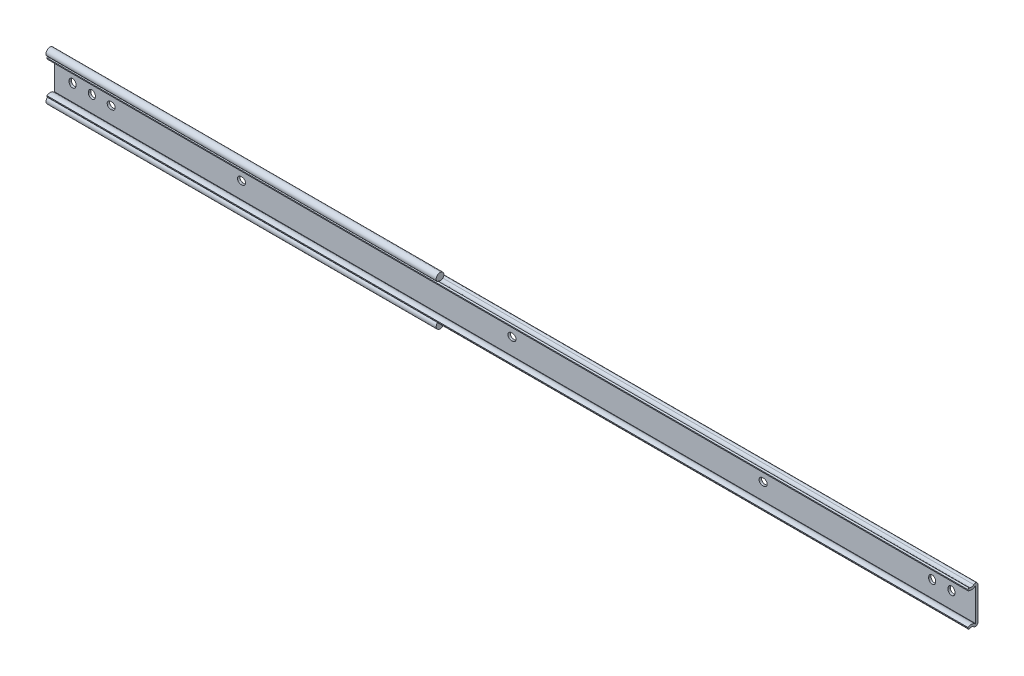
ISO-10303-21;
HEADER;
FILE_DESCRIPTION(('STEP AP214'),'2;1');
FILE_NAME('part.step','',(''),(''),'','','');
FILE_SCHEMA(('AUTOMOTIVE_DESIGN { 1 0 10303 214 1 1 1 1 }'));
ENDSEC;
DATA;
#1=APPLICATION_CONTEXT('core data for automotive mechanical design processes');
#2=APPLICATION_PROTOCOL_DEFINITION('international standard','automotive_design',2000,#1);
#3=PRODUCT_CONTEXT('',#1,'mechanical');
#4=PRODUCT('Part','Part','',(#3));
#5=PRODUCT_RELATED_PRODUCT_CATEGORY('part','',(#4));
#6=PRODUCT_DEFINITION_FORMATION('','',#4);
#7=PRODUCT_DEFINITION_CONTEXT('part definition',#1,'design');
#8=PRODUCT_DEFINITION('design','',#6,#7);
#9=PRODUCT_DEFINITION_SHAPE('','',#8);
#10=(LENGTH_UNIT() NAMED_UNIT(*) SI_UNIT(.MILLI.,.METRE.));
#11=(NAMED_UNIT(*) PLANE_ANGLE_UNIT() SI_UNIT($,.RADIAN.));
#12=(NAMED_UNIT(*) SI_UNIT($,.STERADIAN.) SOLID_ANGLE_UNIT());
#13=UNCERTAINTY_MEASURE_WITH_UNIT(LENGTH_MEASURE(1.E-05),#10,'distance_accuracy_value','');
#14=(GEOMETRIC_REPRESENTATION_CONTEXT(3) GLOBAL_UNCERTAINTY_ASSIGNED_CONTEXT((#13)) GLOBAL_UNIT_ASSIGNED_CONTEXT((#10,
#11,#12)) REPRESENTATION_CONTEXT('',''));
#15=CARTESIAN_POINT('',(0.,0.,0.));
#16=DIRECTION('',(0.,0.,1.));
#17=DIRECTION('',(1.,0.,0.));
#18=AXIS2_PLACEMENT_3D('',#15,#16,#17);
#19=CARTESIAN_POINT('',(-11.9,13.9150000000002,4.44999999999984));
#20=DIRECTION('',(1.,0.,0.));
#21=DIRECTION('',(0.,0.,-1.));
#22=AXIS2_PLACEMENT_3D('',#19,#20,#21);
#23=CYLINDRICAL_SURFACE('',#22,2.55000000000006);
#24=DIRECTION('',(1.,0.,0.));
#25=VECTOR('',#24,1.);
#26=CARTESIAN_POINT('',(-11.9,12.0059666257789,2.75941087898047));
#27=LINE('',#26,#25);
#28=CARTESIAN_POINT('',(244.6,12.0059666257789,2.75941087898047));
#29=VERTEX_POINT('',#28);
#30=CARTESIAN_POINT('',(593.7,12.0059666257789,2.75941087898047));
#31=VERTEX_POINT('',#30);
#32=EDGE_CURVE('E604',#29,#31,#27,.T.);
#33=ORIENTED_EDGE('',*,*,#32,.F.);
#34=CARTESIAN_POINT('',(244.6,13.9150000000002,4.44999999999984));
#35=DIRECTION('',(-1.,0.,0.));
#36=DIRECTION('',(0.,0.,1.));
#37=AXIS2_PLACEMENT_3D('',#34,#35,#36);
#38=CIRCLE('',#37,2.55000000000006);
#39=CARTESIAN_POINT('',(244.6,11.8784795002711,5.98462837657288));
#40=VERTEX_POINT('',#39);
#41=EDGE_CURVE('E357',#29,#40,#38,.T.);
#42=ORIENTED_EDGE('',*,*,#41,.T.);
#43=DIRECTION('',(1.,0.,0.));
#44=VECTOR('',#43,1.);
#45=CARTESIAN_POINT('',(-11.9,11.8784795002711,5.98462837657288));
#46=LINE('',#45,#44);
#47=CARTESIAN_POINT('',(593.7,11.8784795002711,5.98462837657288));
#48=VERTEX_POINT('',#47);
#49=EDGE_CURVE('E603',#40,#48,#46,.T.);
#50=ORIENTED_EDGE('',*,*,#49,.T.);
#51=CARTESIAN_POINT('',(593.7,13.9150000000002,4.44999999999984));
#52=DIRECTION('',(-1.,0.,0.));
#53=DIRECTION('',(0.,0.,1.));
#54=AXIS2_PLACEMENT_3D('',#51,#52,#53);
#55=CIRCLE('',#54,2.55000000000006);
#56=EDGE_CURVE('E531',#31,#48,#55,.T.);
#57=ORIENTED_EDGE('',*,*,#56,.F.);
#58=EDGE_LOOP('',(#33,#42,#50,#57));
#59=FACE_BOUND('',#58,.T.);
#60=ADVANCED_FACE('F14',(#59),#23,.F.);
#61=CARTESIAN_POINT('',(-11.9,-10.7622239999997,0.));
#62=DIRECTION('',(0.,0.,-1.));
#63=DIRECTION('',(-1.,0.,0.));
#64=AXIS2_PLACEMENT_3D('',#61,#62,#63);
#65=PLANE('',#64);
#66=DIRECTION('',(0.,1.,0.));
#67=VECTOR('',#66,1.);
#68=CARTESIAN_POINT('',(-11.9,-10.7622239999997,0.));
#69=LINE('',#68,#67);
#70=CARTESIAN_POINT('',(-11.9,-10.7622239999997,0.));
#71=VERTEX_POINT('',#70);
#72=CARTESIAN_POINT('',(-11.9,10.7622240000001,0.));
#73=VERTEX_POINT('',#72);
#74=EDGE_CURVE('E599',#71,#73,#69,.T.);
#75=ORIENTED_EDGE('',*,*,#74,.T.);
#76=DIRECTION('',(1.,0.,0.));
#77=VECTOR('',#76,1.);
#78=CARTESIAN_POINT('',(-11.9,10.7622240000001,0.));
#79=LINE('',#78,#77);
#80=CARTESIAN_POINT('',(593.7,10.7622240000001,0.));
#81=VERTEX_POINT('',#80);
#82=EDGE_CURVE('E607',#73,#81,#79,.T.);
#83=ORIENTED_EDGE('',*,*,#82,.T.);
#84=DIRECTION('',(0.,1.,0.));
#85=VECTOR('',#84,1.);
#86=CARTESIAN_POINT('',(593.7,-10.7622239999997,0.));
#87=LINE('',#86,#85);
#88=CARTESIAN_POINT('',(593.7,-10.7622239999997,0.));
#89=VERTEX_POINT('',#88);
#90=EDGE_CURVE('E572',#89,#81,#87,.T.);
#91=ORIENTED_EDGE('',*,*,#90,.F.);
#92=DIRECTION('',(1.,0.,0.));
#93=VECTOR('',#92,1.);
#94=CARTESIAN_POINT('',(-11.9,-10.7622239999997,0.));
#95=LINE('',#94,#93);
#96=EDGE_CURVE('E609',#71,#89,#95,.T.);
#97=ORIENTED_EDGE('',*,*,#96,.F.);
#98=EDGE_LOOP('',(#75,#83,#91,#97));
#99=FACE_BOUND('',#98,.T.);
#100=CARTESIAN_POINT('',(454.400000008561,0.00222400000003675,0.));
#101=DIRECTION('',(0.,0.,-1.));
#102=DIRECTION('',(-1.,0.,0.));
#103=AXIS2_PLACEMENT_3D('',#100,#101,#102);
#104=CIRCLE('',#103,2.25);
#105=CARTESIAN_POINT('',(454.400000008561,2.25222400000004,0.));
#106=VERTEX_POINT('',#105);
#107=CARTESIAN_POINT('',(454.400000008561,-2.24777599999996,0.));
#108=VERTEX_POINT('',#107);
#109=EDGE_CURVE('E374',#106,#108,#104,.T.);
#110=ORIENTED_EDGE('',*,*,#109,.F.);
#111=DIRECTION('',(1.,0.,0.));
#112=VECTOR('',#111,1.);
#113=CARTESIAN_POINT('',(453.600000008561,2.25222400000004,0.));
#114=LINE('',#113,#112);
#115=CARTESIAN_POINT('',(453.600000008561,2.25222400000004,0.));
#116=VERTEX_POINT('',#115);
#117=EDGE_CURVE('E382',#116,#106,#114,.T.);
#118=ORIENTED_EDGE('',*,*,#117,.F.);
#119=CARTESIAN_POINT('',(453.600000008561,0.00222400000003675,0.));
#120=DIRECTION('',(0.,0.,-1.));
#121=DIRECTION('',(-1.,0.,0.));
#122=AXIS2_PLACEMENT_3D('',#119,#120,#121);
#123=CIRCLE('',#122,2.25);
#124=CARTESIAN_POINT('',(453.600000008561,-2.24777599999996,0.));
#125=VERTEX_POINT('',#124);
#126=EDGE_CURVE('E379',#125,#116,#123,.T.);
#127=ORIENTED_EDGE('',*,*,#126,.F.);
#128=DIRECTION('',(-1.,0.,0.));
#129=VECTOR('',#128,1.);
#130=CARTESIAN_POINT('',(454.400000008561,-2.24777599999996,0.));
#131=LINE('',#130,#129);
#132=EDGE_CURVE('E376',#108,#125,#131,.T.);
#133=ORIENTED_EDGE('',*,*,#132,.F.);
#134=EDGE_LOOP('',(#110,#118,#127,#133));
#135=FACE_BOUND('',#134,.T.);
#136=CARTESIAN_POINT('',(110.700000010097,0.0030699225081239,0.));
#137=DIRECTION('',(0.,0.,-1.));
#138=DIRECTION('',(-1.,0.,0.));
#139=AXIS2_PLACEMENT_3D('',#136,#137,#138);
#140=CIRCLE('',#139,2.25);
#141=CARTESIAN_POINT('',(110.700000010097,-2.24693007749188,0.));
#142=VERTEX_POINT('',#141);
#143=CARTESIAN_POINT('',(110.700000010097,2.25306992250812,0.));
#144=VERTEX_POINT('',#143);
#145=EDGE_CURVE('E397',#142,#144,#140,.T.);
#146=ORIENTED_EDGE('',*,*,#145,.F.);
#147=DIRECTION('',(-1.,0.,0.));
#148=VECTOR('',#147,1.);
#149=CARTESIAN_POINT('',(111.500000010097,-2.24693007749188,0.));
#150=LINE('',#149,#148);
#151=CARTESIAN_POINT('',(111.500000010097,-2.24693007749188,0.));
#152=VERTEX_POINT('',#151);
#153=EDGE_CURVE('E405',#152,#142,#150,.T.);
#154=ORIENTED_EDGE('',*,*,#153,.F.);
#155=CARTESIAN_POINT('',(111.500000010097,0.0030699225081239,0.));
#156=DIRECTION('',(0.,0.,-1.));
#157=DIRECTION('',(-1.,0.,0.));
#158=AXIS2_PLACEMENT_3D('',#155,#156,#157);
#159=CIRCLE('',#158,2.25);
#160=CARTESIAN_POINT('',(111.500000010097,2.25306992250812,0.));
#161=VERTEX_POINT('',#160);
#162=EDGE_CURVE('E402',#161,#152,#159,.T.);
#163=ORIENTED_EDGE('',*,*,#162,.F.);
#164=DIRECTION('',(1.,0.,0.));
#165=VECTOR('',#164,1.);
#166=CARTESIAN_POINT('',(110.700000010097,2.25306992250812,0.));
#167=LINE('',#166,#165);
#168=EDGE_CURVE('E399',#144,#161,#167,.T.);
#169=ORIENTED_EDGE('',*,*,#168,.F.);
#170=EDGE_LOOP('',(#146,#154,#163,#169));
#171=FACE_BOUND('',#170,.T.);
#172=CARTESIAN_POINT('',(288.50000000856,0.00222400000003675,0.));
#173=DIRECTION('',(0.,0.,-1.));
#174=DIRECTION('',(-1.,0.,0.));
#175=AXIS2_PLACEMENT_3D('',#172,#173,#174);
#176=CIRCLE('',#175,2.25);
#177=CARTESIAN_POINT('',(288.50000000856,-2.24777599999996,0.));
#178=VERTEX_POINT('',#177);
#179=CARTESIAN_POINT('',(288.50000000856,2.25222400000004,0.));
#180=VERTEX_POINT('',#179);
#181=EDGE_CURVE('E411',#178,#180,#176,.T.);
#182=ORIENTED_EDGE('',*,*,#181,.F.);
#183=DIRECTION('',(-1.,0.,0.));
#184=VECTOR('',#183,1.);
#185=CARTESIAN_POINT('',(289.30000000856,-2.24777599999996,0.));
#186=LINE('',#185,#184);
#187=CARTESIAN_POINT('',(289.30000000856,-2.24777599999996,0.));
#188=VERTEX_POINT('',#187);
#189=EDGE_CURVE('E425',#188,#178,#186,.T.);
#190=ORIENTED_EDGE('',*,*,#189,.F.);
#191=CARTESIAN_POINT('',(289.30000000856,0.00222400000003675,0.));
#192=DIRECTION('',(0.,0.,-1.));
#193=DIRECTION('',(-1.,0.,0.));
#194=AXIS2_PLACEMENT_3D('',#191,#192,#193);
#195=CIRCLE('',#194,2.25);
#196=CARTESIAN_POINT('',(289.30000000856,2.25222400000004,0.));
#197=VERTEX_POINT('',#196);
#198=EDGE_CURVE('E422',#197,#188,#195,.T.);
#199=ORIENTED_EDGE('',*,*,#198,.F.);
#200=DIRECTION('',(1.,0.,0.));
#201=VECTOR('',#200,1.);
#202=CARTESIAN_POINT('',(288.50000000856,2.25222400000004,0.));
#203=LINE('',#202,#201);
#204=EDGE_CURVE('E419',#180,#197,#203,.T.);
#205=ORIENTED_EDGE('',*,*,#204,.F.);
#206=EDGE_LOOP('',(#182,#190,#199,#205));
#207=FACE_BOUND('',#206,.T.);
#208=CARTESIAN_POINT('',(25.000000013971,0.00392880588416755,0.));
#209=DIRECTION('',(0.,0.,-1.));
#210=DIRECTION('',(-1.,0.,0.));
#211=AXIS2_PLACEMENT_3D('',#208,#209,#210);
#212=CIRCLE('',#211,2.25);
#213=CARTESIAN_POINT('',(25.000000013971,-2.24607119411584,0.));
#214=VERTEX_POINT('',#213);
#215=CARTESIAN_POINT('',(25.000000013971,2.25392880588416,0.));
#216=VERTEX_POINT('',#215);
#217=EDGE_CURVE('E431',#214,#216,#212,.T.);
#218=ORIENTED_EDGE('',*,*,#217,.F.);
#219=DIRECTION('',(-1.,0.,0.));
#220=VECTOR('',#219,1.);
#221=CARTESIAN_POINT('',(25.800000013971,-2.24607119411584,0.));
#222=LINE('',#221,#220);
#223=CARTESIAN_POINT('',(25.800000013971,-2.24607119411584,0.));
#224=VERTEX_POINT('',#223);
#225=EDGE_CURVE('E445',#224,#214,#222,.T.);
#226=ORIENTED_EDGE('',*,*,#225,.F.);
#227=CARTESIAN_POINT('',(25.800000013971,0.00392880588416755,0.));
#228=DIRECTION('',(0.,0.,-1.));
#229=DIRECTION('',(-1.,0.,0.));
#230=AXIS2_PLACEMENT_3D('',#227,#228,#229);
#231=CIRCLE('',#230,2.25);
#232=CARTESIAN_POINT('',(25.800000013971,2.25392880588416,0.));
#233=VERTEX_POINT('',#232);
#234=EDGE_CURVE('E442',#233,#224,#231,.T.);
#235=ORIENTED_EDGE('',*,*,#234,.F.);
#236=DIRECTION('',(1.,0.,0.));
#237=VECTOR('',#236,1.);
#238=CARTESIAN_POINT('',(25.000000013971,2.25392880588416,0.));
#239=LINE('',#238,#237);
#240=EDGE_CURVE('E439',#216,#233,#239,.T.);
#241=ORIENTED_EDGE('',*,*,#240,.F.);
#242=EDGE_LOOP('',(#218,#226,#235,#241));
#243=FACE_BOUND('',#242,.T.);
#244=CARTESIAN_POINT('',(0.,-0.400000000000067,0.));
#245=DIRECTION('',(0.,0.,-1.));
#246=DIRECTION('',(1.,0.,0.));
#247=AXIS2_PLACEMENT_3D('',#244,#245,#246);
#248=CIRCLE('',#247,2.24999999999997);
#249=CARTESIAN_POINT('',(2.24999999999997,-0.400000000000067,0.));
#250=VERTEX_POINT('',#249);
#251=CARTESIAN_POINT('',(-2.24999999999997,-0.400000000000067,0.));
#252=VERTEX_POINT('',#251);
#253=EDGE_CURVE('E451',#250,#252,#248,.T.);
#254=ORIENTED_EDGE('',*,*,#253,.F.);
#255=DIRECTION('',(0.,-1.,0.));
#256=VECTOR('',#255,1.);
#257=CARTESIAN_POINT('',(2.24999999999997,-0.400000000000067,0.));
#258=LINE('',#257,#256);
#259=CARTESIAN_POINT('',(2.24999999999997,0.400000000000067,0.));
#260=VERTEX_POINT('',#259);
#261=EDGE_CURVE('E465',#260,#250,#258,.T.);
#262=ORIENTED_EDGE('',*,*,#261,.F.);
#263=CARTESIAN_POINT('',(0.,0.400000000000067,0.));
#264=DIRECTION('',(0.,0.,-1.));
#265=DIRECTION('',(1.,0.,0.));
#266=AXIS2_PLACEMENT_3D('',#263,#264,#265);
#267=CIRCLE('',#266,2.24999999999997);
#268=CARTESIAN_POINT('',(-2.24999999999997,0.400000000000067,0.));
#269=VERTEX_POINT('',#268);
#270=EDGE_CURVE('E462',#269,#260,#267,.T.);
#271=ORIENTED_EDGE('',*,*,#270,.F.);
#272=DIRECTION('',(0.,1.,0.));
#273=VECTOR('',#272,1.);
#274=CARTESIAN_POINT('',(-2.24999999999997,-0.400000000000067,0.));
#275=LINE('',#274,#273);
#276=EDGE_CURVE('E459',#252,#269,#275,.T.);
#277=ORIENTED_EDGE('',*,*,#276,.F.);
#278=EDGE_LOOP('',(#254,#262,#271,#277));
#279=FACE_BOUND('',#278,.T.);
#280=CARTESIAN_POINT('',(12.7,-0.400000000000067,0.));
#281=DIRECTION('',(0.,0.,-1.));
#282=DIRECTION('',(1.,0.,0.));
#283=AXIS2_PLACEMENT_3D('',#280,#281,#282);
#284=CIRCLE('',#283,2.24999999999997);
#285=CARTESIAN_POINT('',(14.95,-0.400000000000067,0.));
#286=VERTEX_POINT('',#285);
#287=CARTESIAN_POINT('',(10.45,-0.400000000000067,0.));
#288=VERTEX_POINT('',#287);
#289=EDGE_CURVE('E471',#286,#288,#284,.T.);
#290=ORIENTED_EDGE('',*,*,#289,.F.);
#291=DIRECTION('',(0.,-1.,0.));
#292=VECTOR('',#291,1.);
#293=CARTESIAN_POINT('',(14.95,-0.400000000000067,0.));
#294=LINE('',#293,#292);
#295=CARTESIAN_POINT('',(14.95,0.400000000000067,0.));
#296=VERTEX_POINT('',#295);
#297=EDGE_CURVE('E485',#296,#286,#294,.T.);
#298=ORIENTED_EDGE('',*,*,#297,.F.);
#299=CARTESIAN_POINT('',(12.7,0.400000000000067,0.));
#300=DIRECTION('',(0.,0.,-1.));
#301=DIRECTION('',(1.,0.,0.));
#302=AXIS2_PLACEMENT_3D('',#299,#300,#301);
#303=CIRCLE('',#302,2.24999999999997);
#304=CARTESIAN_POINT('',(10.45,0.400000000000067,0.));
#305=VERTEX_POINT('',#304);
#306=EDGE_CURVE('E482',#305,#296,#303,.T.);
#307=ORIENTED_EDGE('',*,*,#306,.F.);
#308=DIRECTION('',(0.,1.,0.));
#309=VECTOR('',#308,1.);
#310=CARTESIAN_POINT('',(10.45,-0.400000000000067,0.));
#311=LINE('',#310,#309);
#312=EDGE_CURVE('E479',#288,#305,#311,.T.);
#313=ORIENTED_EDGE('',*,*,#312,.F.);
#314=EDGE_LOOP('',(#290,#298,#307,#313));
#315=FACE_BOUND('',#314,.T.);
#316=CARTESIAN_POINT('',(565.1,-0.400000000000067,0.));
#317=DIRECTION('',(0.,0.,-1.));
#318=DIRECTION('',(1.,0.,0.));
#319=AXIS2_PLACEMENT_3D('',#316,#317,#318);
#320=CIRCLE('',#319,2.24999999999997);
#321=CARTESIAN_POINT('',(567.35,-0.400000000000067,0.));
#322=VERTEX_POINT('',#321);
#323=CARTESIAN_POINT('',(562.85,-0.400000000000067,0.));
#324=VERTEX_POINT('',#323);
#325=EDGE_CURVE('E491',#322,#324,#320,.T.);
#326=ORIENTED_EDGE('',*,*,#325,.F.);
#327=DIRECTION('',(0.,-1.,0.));
#328=VECTOR('',#327,1.);
#329=CARTESIAN_POINT('',(567.35,-0.400000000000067,0.));
#330=LINE('',#329,#328);
#331=CARTESIAN_POINT('',(567.35,0.400000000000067,0.));
#332=VERTEX_POINT('',#331);
#333=EDGE_CURVE('E505',#332,#322,#330,.T.);
#334=ORIENTED_EDGE('',*,*,#333,.F.);
#335=CARTESIAN_POINT('',(565.1,0.400000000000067,0.));
#336=DIRECTION('',(0.,0.,-1.));
#337=DIRECTION('',(1.,0.,0.));
#338=AXIS2_PLACEMENT_3D('',#335,#336,#337);
#339=CIRCLE('',#338,2.24999999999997);
#340=CARTESIAN_POINT('',(562.85,0.400000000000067,0.));
#341=VERTEX_POINT('',#340);
#342=EDGE_CURVE('E502',#341,#332,#339,.T.);
#343=ORIENTED_EDGE('',*,*,#342,.F.);
#344=DIRECTION('',(0.,1.,0.));
#345=VECTOR('',#344,1.);
#346=CARTESIAN_POINT('',(562.85,-0.400000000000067,0.));
#347=LINE('',#346,#345);
#348=EDGE_CURVE('E499',#324,#341,#347,.T.);
#349=ORIENTED_EDGE('',*,*,#348,.F.);
#350=EDGE_LOOP('',(#326,#334,#343,#349));
#351=FACE_BOUND('',#350,.T.);
#352=CARTESIAN_POINT('',(577.8,-0.400000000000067,0.));
#353=DIRECTION('',(0.,0.,-1.));
#354=DIRECTION('',(1.,0.,0.));
#355=AXIS2_PLACEMENT_3D('',#352,#353,#354);
#356=CIRCLE('',#355,2.24999999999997);
#357=CARTESIAN_POINT('',(580.05,-0.400000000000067,0.));
#358=VERTEX_POINT('',#357);
#359=CARTESIAN_POINT('',(575.55,-0.400000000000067,0.));
#360=VERTEX_POINT('',#359);
#361=EDGE_CURVE('E511',#358,#360,#356,.T.);
#362=ORIENTED_EDGE('',*,*,#361,.F.);
#363=DIRECTION('',(0.,-1.,0.));
#364=VECTOR('',#363,1.);
#365=CARTESIAN_POINT('',(580.05,-0.400000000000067,0.));
#366=LINE('',#365,#364);
#367=CARTESIAN_POINT('',(580.05,0.400000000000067,0.));
#368=VERTEX_POINT('',#367);
#369=EDGE_CURVE('E525',#368,#358,#366,.T.);
#370=ORIENTED_EDGE('',*,*,#369,.F.);
#371=CARTESIAN_POINT('',(577.8,0.400000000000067,0.));
#372=DIRECTION('',(0.,0.,-1.));
#373=DIRECTION('',(1.,0.,0.));
#374=AXIS2_PLACEMENT_3D('',#371,#372,#373);
#375=CIRCLE('',#374,2.24999999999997);
#376=CARTESIAN_POINT('',(575.55,0.400000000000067,0.));
#377=VERTEX_POINT('',#376);
#378=EDGE_CURVE('E522',#377,#368,#375,.T.);
#379=ORIENTED_EDGE('',*,*,#378,.F.);
#380=DIRECTION('',(0.,1.,0.));
#381=VECTOR('',#380,1.);
#382=CARTESIAN_POINT('',(575.55,-0.400000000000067,0.));
#383=LINE('',#382,#381);
#384=EDGE_CURVE('E519',#360,#377,#383,.T.);
#385=ORIENTED_EDGE('',*,*,#384,.F.);
#386=EDGE_LOOP('',(#362,#370,#379,#385));
#387=FACE_BOUND('',#386,.T.);
#388=ADVANCED_FACE('F722',(#99,#135,#171,#207,#243,#279,#315,#351,#387),#65,.T.);
#389=CARTESIAN_POINT('',(-11.9,10.7622240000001,1.54999999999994));
#390=DIRECTION('',(0.,0.,1.));
#391=DIRECTION('',(1.,0.,0.));
#392=AXIS2_PLACEMENT_3D('',#389,#390,#391);
#393=PLANE('',#392);
#394=DIRECTION('',(0.,-1.,0.));
#395=VECTOR('',#394,1.);
#396=CARTESIAN_POINT('',(-11.9,10.7622240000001,1.54999999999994));
#397=LINE('',#396,#395);
#398=CARTESIAN_POINT('',(-11.9,10.7622240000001,1.54999999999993));
#399=VERTEX_POINT('',#398);
#400=CARTESIAN_POINT('',(-11.9,-10.7622239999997,1.54999999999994));
#401=VERTEX_POINT('',#400);
#402=EDGE_CURVE('E584',#399,#401,#397,.T.);
#403=ORIENTED_EDGE('',*,*,#402,.T.);
#404=DIRECTION('',(1.,0.,0.));
#405=VECTOR('',#404,1.);
#406=CARTESIAN_POINT('',(-11.9,-10.7622239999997,1.54999999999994));
#407=LINE('',#406,#405);
#408=CARTESIAN_POINT('',(593.7,-10.7622239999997,1.54999999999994));
#409=VERTEX_POINT('',#408);
#410=EDGE_CURVE('E622',#401,#409,#407,.T.);
#411=ORIENTED_EDGE('',*,*,#410,.T.);
#412=DIRECTION('',(0.,-1.,0.));
#413=VECTOR('',#412,1.);
#414=CARTESIAN_POINT('',(593.7,10.7622240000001,1.54999999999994));
#415=LINE('',#414,#413);
#416=CARTESIAN_POINT('',(593.7,10.7622240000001,1.54999999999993));
#417=VERTEX_POINT('',#416);
#418=EDGE_CURVE('E552',#417,#409,#415,.T.);
#419=ORIENTED_EDGE('',*,*,#418,.F.);
#420=DIRECTION('',(1.,0.,0.));
#421=VECTOR('',#420,1.);
#422=CARTESIAN_POINT('',(-11.9,10.7622240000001,1.54999999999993));
#423=LINE('',#422,#421);
#424=EDGE_CURVE('E624',#399,#417,#423,.T.);
#425=ORIENTED_EDGE('',*,*,#424,.F.);
#426=EDGE_LOOP('',(#403,#411,#419,#425));
#427=FACE_BOUND('',#426,.T.);
#428=CARTESIAN_POINT('',(454.400000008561,0.00222400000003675,1.54999999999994));
#429=DIRECTION('',(0.,0.,1.));
#430=DIRECTION('',(1.,0.,0.));
#431=AXIS2_PLACEMENT_3D('',#428,#429,#430);
#432=CIRCLE('',#431,2.25);
#433=CARTESIAN_POINT('',(454.400000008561,2.25222400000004,1.54999999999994));
#434=VERTEX_POINT('',#433);
#435=CARTESIAN_POINT('',(454.400000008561,-2.24777599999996,1.54999999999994));
#436=VERTEX_POINT('',#435);
#437=EDGE_CURVE('E371',#434,#436,#432,.F.);
#438=ORIENTED_EDGE('',*,*,#437,.T.);
#439=DIRECTION('',(-1.,0.,0.));
#440=VECTOR('',#439,1.);
#441=CARTESIAN_POINT('',(454.400000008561,-2.24777599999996,1.54999999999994));
#442=LINE('',#441,#440);
#443=CARTESIAN_POINT('',(453.600000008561,-2.24777599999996,1.54999999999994));
#444=VERTEX_POINT('',#443);
#445=EDGE_CURVE('E388',#436,#444,#442,.T.);
#446=ORIENTED_EDGE('',*,*,#445,.T.);
#447=CARTESIAN_POINT('',(453.600000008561,0.00222400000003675,1.54999999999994));
#448=DIRECTION('',(0.,0.,1.));
#449=DIRECTION('',(1.,0.,0.));
#450=AXIS2_PLACEMENT_3D('',#447,#448,#449);
#451=CIRCLE('',#450,2.25);
#452=CARTESIAN_POINT('',(453.600000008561,2.25222400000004,1.54999999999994));
#453=VERTEX_POINT('',#452);
#454=EDGE_CURVE('E365',#444,#453,#451,.F.);
#455=ORIENTED_EDGE('',*,*,#454,.T.);
#456=DIRECTION('',(1.,0.,0.));
#457=VECTOR('',#456,1.);
#458=CARTESIAN_POINT('',(453.600000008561,2.25222400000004,1.54999999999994));
#459=LINE('',#458,#457);
#460=EDGE_CURVE('E368',#453,#434,#459,.T.);
#461=ORIENTED_EDGE('',*,*,#460,.T.);
#462=EDGE_LOOP('',(#438,#446,#455,#461));
#463=FACE_BOUND('',#462,.T.);
#464=CARTESIAN_POINT('',(110.700000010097,0.0030699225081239,1.54999999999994));
#465=DIRECTION('',(0.,0.,1.));
#466=DIRECTION('',(1.,0.,0.));
#467=AXIS2_PLACEMENT_3D('',#464,#465,#466);
#468=CIRCLE('',#467,2.25);
#469=CARTESIAN_POINT('',(110.700000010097,2.25306992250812,1.54999999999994));
#470=VERTEX_POINT('',#469);
#471=CARTESIAN_POINT('',(110.700000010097,-2.24693007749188,1.54999999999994));
#472=VERTEX_POINT('',#471);
#473=EDGE_CURVE('E693',#470,#472,#468,.T.);
#474=ORIENTED_EDGE('',*,*,#473,.F.);
#475=DIRECTION('',(-1.,0.,0.));
#476=VECTOR('',#475,1.);
#477=CARTESIAN_POINT('',(-11.9,2.25306992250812,1.54999999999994));
#478=LINE('',#477,#476);
#479=CARTESIAN_POINT('',(111.500000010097,2.25306992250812,1.54999999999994));
#480=VERTEX_POINT('',#479);
#481=EDGE_CURVE('E686',#480,#470,#478,.T.);
#482=ORIENTED_EDGE('',*,*,#481,.F.);
#483=CARTESIAN_POINT('',(111.500000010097,0.0030699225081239,1.54999999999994));
#484=DIRECTION('',(0.,0.,1.));
#485=DIRECTION('',(1.,0.,0.));
#486=AXIS2_PLACEMENT_3D('',#483,#484,#485);
#487=CIRCLE('',#486,2.25);
#488=CARTESIAN_POINT('',(111.500000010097,-2.24693007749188,1.54999999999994));
#489=VERTEX_POINT('',#488);
#490=EDGE_CURVE('E688',#489,#480,#487,.T.);
#491=ORIENTED_EDGE('',*,*,#490,.F.);
#492=DIRECTION('',(1.,0.,0.));
#493=VECTOR('',#492,1.);
#494=CARTESIAN_POINT('',(-11.9,-2.24693007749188,1.54999999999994));
#495=LINE('',#494,#493);
#496=EDGE_CURVE('E691',#472,#489,#495,.T.);
#497=ORIENTED_EDGE('',*,*,#496,.F.);
#498=EDGE_LOOP('',(#474,#482,#491,#497));
#499=FACE_BOUND('',#498,.T.);
#500=CARTESIAN_POINT('',(288.50000000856,0.00222400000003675,1.54999999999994));
#501=DIRECTION('',(0.,0.,1.));
#502=DIRECTION('',(1.,0.,0.));
#503=AXIS2_PLACEMENT_3D('',#500,#501,#502);
#504=CIRCLE('',#503,2.25);
#505=CARTESIAN_POINT('',(288.50000000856,2.25222400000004,1.54999999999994));
#506=VERTEX_POINT('',#505);
#507=CARTESIAN_POINT('',(288.50000000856,-2.24777599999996,1.54999999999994));
#508=VERTEX_POINT('',#507);
#509=EDGE_CURVE('E684',#506,#508,#504,.T.);
#510=ORIENTED_EDGE('',*,*,#509,.F.);
#511=DIRECTION('',(-1.,0.,0.));
#512=VECTOR('',#511,1.);
#513=CARTESIAN_POINT('',(-11.9,2.25222400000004,1.54999999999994));
#514=LINE('',#513,#512);
#515=CARTESIAN_POINT('',(289.30000000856,2.25222400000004,1.54999999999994));
#516=VERTEX_POINT('',#515);
#517=EDGE_CURVE('E677',#516,#506,#514,.T.);
#518=ORIENTED_EDGE('',*,*,#517,.F.);
#519=CARTESIAN_POINT('',(289.30000000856,0.00222400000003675,1.54999999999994));
#520=DIRECTION('',(0.,0.,1.));
#521=DIRECTION('',(1.,0.,0.));
#522=AXIS2_PLACEMENT_3D('',#519,#520,#521);
#523=CIRCLE('',#522,2.25);
#524=CARTESIAN_POINT('',(289.30000000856,-2.24777599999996,1.54999999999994));
#525=VERTEX_POINT('',#524);
#526=EDGE_CURVE('E679',#525,#516,#523,.T.);
#527=ORIENTED_EDGE('',*,*,#526,.F.);
#528=DIRECTION('',(1.,0.,0.));
#529=VECTOR('',#528,1.);
#530=CARTESIAN_POINT('',(-11.9,-2.24777599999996,1.54999999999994));
#531=LINE('',#530,#529);
#532=EDGE_CURVE('E682',#508,#525,#531,.T.);
#533=ORIENTED_EDGE('',*,*,#532,.F.);
#534=EDGE_LOOP('',(#510,#518,#527,#533));
#535=FACE_BOUND('',#534,.T.);
#536=CARTESIAN_POINT('',(25.000000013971,0.00392880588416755,1.54999999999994));
#537=DIRECTION('',(0.,0.,1.));
#538=DIRECTION('',(1.,0.,0.));
#539=AXIS2_PLACEMENT_3D('',#536,#537,#538);
#540=CIRCLE('',#539,2.25);
#541=CARTESIAN_POINT('',(25.000000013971,2.25392880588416,1.54999999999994));
#542=VERTEX_POINT('',#541);
#543=CARTESIAN_POINT('',(25.000000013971,-2.24607119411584,1.54999999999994));
#544=VERTEX_POINT('',#543);
#545=EDGE_CURVE('E675',#542,#544,#540,.T.);
#546=ORIENTED_EDGE('',*,*,#545,.F.);
#547=DIRECTION('',(-1.,0.,0.));
#548=VECTOR('',#547,1.);
#549=CARTESIAN_POINT('',(-11.9,2.25392880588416,1.54999999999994));
#550=LINE('',#549,#548);
#551=CARTESIAN_POINT('',(25.800000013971,2.25392880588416,1.54999999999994));
#552=VERTEX_POINT('',#551);
#553=EDGE_CURVE('E668',#552,#542,#550,.T.);
#554=ORIENTED_EDGE('',*,*,#553,.F.);
#555=CARTESIAN_POINT('',(25.800000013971,0.00392880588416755,1.54999999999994));
#556=DIRECTION('',(0.,0.,1.));
#557=DIRECTION('',(1.,0.,0.));
#558=AXIS2_PLACEMENT_3D('',#555,#556,#557);
#559=CIRCLE('',#558,2.25);
#560=CARTESIAN_POINT('',(25.800000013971,-2.24607119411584,1.54999999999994));
#561=VERTEX_POINT('',#560);
#562=EDGE_CURVE('E670',#561,#552,#559,.T.);
#563=ORIENTED_EDGE('',*,*,#562,.F.);
#564=DIRECTION('',(1.,0.,0.));
#565=VECTOR('',#564,1.);
#566=CARTESIAN_POINT('',(-11.9,-2.24607119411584,1.54999999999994));
#567=LINE('',#566,#565);
#568=EDGE_CURVE('E673',#544,#561,#567,.T.);
#569=ORIENTED_EDGE('',*,*,#568,.F.);
#570=EDGE_LOOP('',(#546,#554,#563,#569));
#571=FACE_BOUND('',#570,.T.);
#572=CARTESIAN_POINT('',(0.,-0.400000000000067,1.54999999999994));
#573=DIRECTION('',(0.,0.,1.));
#574=DIRECTION('',(1.,0.,0.));
#575=AXIS2_PLACEMENT_3D('',#572,#573,#574);
#576=CIRCLE('',#575,2.24999999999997);
#577=CARTESIAN_POINT('',(-2.24999999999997,-0.400000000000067,1.54999999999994));
#578=VERTEX_POINT('',#577);
#579=CARTESIAN_POINT('',(2.24999999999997,-0.400000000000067,1.54999999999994));
#580=VERTEX_POINT('',#579);
#581=EDGE_CURVE('E666',#578,#580,#576,.T.);
#582=ORIENTED_EDGE('',*,*,#581,.F.);
#583=DIRECTION('',(0.,-1.,0.));
#584=VECTOR('',#583,1.);
#585=CARTESIAN_POINT('',(-2.24999999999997,10.7622240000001,1.54999999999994));
#586=LINE('',#585,#584);
#587=CARTESIAN_POINT('',(-2.24999999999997,0.400000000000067,1.54999999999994));
#588=VERTEX_POINT('',#587);
#589=EDGE_CURVE('E659',#588,#578,#586,.T.);
#590=ORIENTED_EDGE('',*,*,#589,.F.);
#591=CARTESIAN_POINT('',(0.,0.400000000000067,1.54999999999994));
#592=DIRECTION('',(0.,0.,1.));
#593=DIRECTION('',(1.,0.,0.));
#594=AXIS2_PLACEMENT_3D('',#591,#592,#593);
#595=CIRCLE('',#594,2.24999999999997);
#596=CARTESIAN_POINT('',(2.24999999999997,0.400000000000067,1.54999999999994));
#597=VERTEX_POINT('',#596);
#598=EDGE_CURVE('E661',#597,#588,#595,.T.);
#599=ORIENTED_EDGE('',*,*,#598,.F.);
#600=DIRECTION('',(0.,1.,0.));
#601=VECTOR('',#600,1.);
#602=CARTESIAN_POINT('',(2.24999999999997,10.7622240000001,1.54999999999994));
#603=LINE('',#602,#601);
#604=EDGE_CURVE('E664',#580,#597,#603,.T.);
#605=ORIENTED_EDGE('',*,*,#604,.F.);
#606=EDGE_LOOP('',(#582,#590,#599,#605));
#607=FACE_BOUND('',#606,.T.);
#608=CARTESIAN_POINT('',(12.7,-0.400000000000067,1.54999999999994));
#609=DIRECTION('',(0.,0.,1.));
#610=DIRECTION('',(1.,0.,0.));
#611=AXIS2_PLACEMENT_3D('',#608,#609,#610);
#612=CIRCLE('',#611,2.24999999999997);
#613=CARTESIAN_POINT('',(10.45,-0.400000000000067,1.54999999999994));
#614=VERTEX_POINT('',#613);
#615=CARTESIAN_POINT('',(14.95,-0.400000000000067,1.54999999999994));
#616=VERTEX_POINT('',#615);
#617=EDGE_CURVE('E657',#614,#616,#612,.T.);
#618=ORIENTED_EDGE('',*,*,#617,.F.);
#619=DIRECTION('',(0.,-1.,0.));
#620=VECTOR('',#619,1.);
#621=CARTESIAN_POINT('',(10.45,10.7622240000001,1.54999999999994));
#622=LINE('',#621,#620);
#623=CARTESIAN_POINT('',(10.45,0.400000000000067,1.54999999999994));
#624=VERTEX_POINT('',#623);
#625=EDGE_CURVE('E650',#624,#614,#622,.T.);
#626=ORIENTED_EDGE('',*,*,#625,.F.);
#627=CARTESIAN_POINT('',(12.7,0.400000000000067,1.54999999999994));
#628=DIRECTION('',(0.,0.,1.));
#629=DIRECTION('',(1.,0.,0.));
#630=AXIS2_PLACEMENT_3D('',#627,#628,#629);
#631=CIRCLE('',#630,2.24999999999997);
#632=CARTESIAN_POINT('',(14.95,0.400000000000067,1.54999999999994));
#633=VERTEX_POINT('',#632);
#634=EDGE_CURVE('E652',#633,#624,#631,.T.);
#635=ORIENTED_EDGE('',*,*,#634,.F.);
#636=DIRECTION('',(0.,1.,0.));
#637=VECTOR('',#636,1.);
#638=CARTESIAN_POINT('',(14.95,10.7622240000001,1.54999999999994));
#639=LINE('',#638,#637);
#640=EDGE_CURVE('E655',#616,#633,#639,.T.);
#641=ORIENTED_EDGE('',*,*,#640,.F.);
#642=EDGE_LOOP('',(#618,#626,#635,#641));
#643=FACE_BOUND('',#642,.T.);
#644=CARTESIAN_POINT('',(565.1,-0.400000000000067,1.54999999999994));
#645=DIRECTION('',(0.,0.,1.));
#646=DIRECTION('',(1.,0.,0.));
#647=AXIS2_PLACEMENT_3D('',#644,#645,#646);
#648=CIRCLE('',#647,2.24999999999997);
#649=CARTESIAN_POINT('',(562.85,-0.400000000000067,1.54999999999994));
#650=VERTEX_POINT('',#649);
#651=CARTESIAN_POINT('',(567.35,-0.400000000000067,1.54999999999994));
#652=VERTEX_POINT('',#651);
#653=EDGE_CURVE('E648',#650,#652,#648,.T.);
#654=ORIENTED_EDGE('',*,*,#653,.F.);
#655=DIRECTION('',(0.,-1.,0.));
#656=VECTOR('',#655,1.);
#657=CARTESIAN_POINT('',(562.85,10.7622240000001,1.54999999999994));
#658=LINE('',#657,#656);
#659=CARTESIAN_POINT('',(562.85,0.400000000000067,1.54999999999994));
#660=VERTEX_POINT('',#659);
#661=EDGE_CURVE('E641',#660,#650,#658,.T.);
#662=ORIENTED_EDGE('',*,*,#661,.F.);
#663=CARTESIAN_POINT('',(565.1,0.400000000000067,1.54999999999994));
#664=DIRECTION('',(0.,0.,1.));
#665=DIRECTION('',(1.,0.,0.));
#666=AXIS2_PLACEMENT_3D('',#663,#664,#665);
#667=CIRCLE('',#666,2.24999999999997);
#668=CARTESIAN_POINT('',(567.35,0.400000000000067,1.54999999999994));
#669=VERTEX_POINT('',#668);
#670=EDGE_CURVE('E643',#669,#660,#667,.T.);
#671=ORIENTED_EDGE('',*,*,#670,.F.);
#672=DIRECTION('',(0.,1.,0.));
#673=VECTOR('',#672,1.);
#674=CARTESIAN_POINT('',(567.35,10.7622240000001,1.54999999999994));
#675=LINE('',#674,#673);
#676=EDGE_CURVE('E646',#652,#669,#675,.T.);
#677=ORIENTED_EDGE('',*,*,#676,.F.);
#678=EDGE_LOOP('',(#654,#662,#671,#677));
#679=FACE_BOUND('',#678,.T.);
#680=CARTESIAN_POINT('',(577.8,-0.400000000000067,1.54999999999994));
#681=DIRECTION('',(0.,0.,1.));
#682=DIRECTION('',(1.,0.,0.));
#683=AXIS2_PLACEMENT_3D('',#680,#681,#682);
#684=CIRCLE('',#683,2.24999999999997);
#685=CARTESIAN_POINT('',(575.55,-0.400000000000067,1.54999999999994));
#686=VERTEX_POINT('',#685);
#687=CARTESIAN_POINT('',(580.05,-0.400000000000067,1.54999999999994));
#688=VERTEX_POINT('',#687);
#689=EDGE_CURVE('E639',#686,#688,#684,.T.);
#690=ORIENTED_EDGE('',*,*,#689,.F.);
#691=DIRECTION('',(0.,-1.,0.));
#692=VECTOR('',#691,1.);
#693=CARTESIAN_POINT('',(575.55,10.7622240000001,1.54999999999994));
#694=LINE('',#693,#692);
#695=CARTESIAN_POINT('',(575.55,0.400000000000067,1.54999999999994));
#696=VERTEX_POINT('',#695);
#697=EDGE_CURVE('E606',#696,#686,#694,.T.);
#698=ORIENTED_EDGE('',*,*,#697,.F.);
#699=CARTESIAN_POINT('',(577.8,0.400000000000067,1.54999999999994));
#700=DIRECTION('',(0.,0.,1.));
#701=DIRECTION('',(1.,0.,0.));
#702=AXIS2_PLACEMENT_3D('',#699,#700,#701);
#703=CIRCLE('',#702,2.24999999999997);
#704=CARTESIAN_POINT('',(580.05,0.400000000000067,1.54999999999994));
#705=VERTEX_POINT('',#704);
#706=EDGE_CURVE('E634',#705,#696,#703,.T.);
#707=ORIENTED_EDGE('',*,*,#706,.F.);
#708=DIRECTION('',(0.,1.,0.));
#709=VECTOR('',#708,1.);
#710=CARTESIAN_POINT('',(580.05,10.7622240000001,1.54999999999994));
#711=LINE('',#710,#709);
#712=EDGE_CURVE('E637',#688,#705,#711,.T.);
#713=ORIENTED_EDGE('',*,*,#712,.F.);
#714=EDGE_LOOP('',(#690,#698,#707,#713));
#715=FACE_BOUND('',#714,.T.);
#716=ADVANCED_FACE('F753',(#427,#463,#499,#535,#571,#607,#643,#679,#715),#393,.T.);
#717=CARTESIAN_POINT('',(-11.9,13.9150000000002,4.44999999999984));
#718=DIRECTION('',(-1.,0.,0.));
#719=DIRECTION('',(0.,0.,1.));
#720=AXIS2_PLACEMENT_3D('',#717,#718,#719);
#721=PLANE('',#720);
#722=CARTESIAN_POINT('',(-11.9,-10.7622239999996,1.66));
#723=DIRECTION('',(1.,0.,0.));
#724=DIRECTION('',(0.,0.,1.));
#725=AXIS2_PLACEMENT_3D('',#722,#723,#724);
#726=CIRCLE('',#725,1.66);
#727=CARTESIAN_POINT('',(-11.9,-12.2669175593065,2.36106867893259));
#728=VERTEX_POINT('',#727);
#729=EDGE_CURVE('E597',#728,#71,#726,.T.);
#730=ORIENTED_EDGE('',*,*,#729,.F.);
#731=CARTESIAN_POINT('',(-11.9,-13.5749999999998,4.55));
#732=DIRECTION('',(-1.,0.,0.));
#733=DIRECTION('',(0.,0.,-1.));
#734=AXIS2_PLACEMENT_3D('',#731,#732,#733);
#735=CIRCLE('',#734,2.55);
#736=CARTESIAN_POINT('',(-11.9,-11.6159967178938,6.18242339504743));
#737=VERTEX_POINT('',#736);
#738=EDGE_CURVE('E709',#728,#737,#735,.T.);
#739=ORIENTED_EDGE('',*,*,#738,.T.);
#740=DIRECTION('',(0.,-0.798635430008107,-0.60181512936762));
#741=VECTOR('',#740,1.);
#742=CARTESIAN_POINT('',(-11.9,-11.8784795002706,5.98462837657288));
#743=LINE('',#742,#741);
#744=CARTESIAN_POINT('',(-11.9,-11.0618539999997,6.6));
#745=VERTEX_POINT('',#744);
#746=EDGE_CURVE('E595',#745,#737,#743,.T.);
#747=ORIENTED_EDGE('',*,*,#746,.F.);
#748=DIRECTION('',(0.,-1.,0.));
#749=VECTOR('',#748,1.);
#750=CARTESIAN_POINT('',(-11.9,-11.0618539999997,6.6));
#751=LINE('',#750,#749);
#752=CARTESIAN_POINT('',(-11.9,-10.4239399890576,6.59999999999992));
#753=VERTEX_POINT('',#752);
#754=EDGE_CURVE('E592',#753,#745,#751,.T.);
#755=ORIENTED_EDGE('',*,*,#754,.F.);
#756=CARTESIAN_POINT('',(-11.9,-13.9149999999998,4.44999999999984));
#757=DIRECTION('',(1.,0.,0.));
#758=DIRECTION('',(0.,0.,1.));
#759=AXIS2_PLACEMENT_3D('',#756,#757,#758);
#760=CIRCLE('',#759,4.1);
#761=CARTESIAN_POINT('',(-11.9,-10.8444026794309,1.73312089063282));
#762=VERTEX_POINT('',#761);
#763=EDGE_CURVE('E589',#762,#753,#760,.T.);
#764=ORIENTED_EDGE('',*,*,#763,.F.);
#765=CARTESIAN_POINT('',(-11.9,-10.7622239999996,1.66));
#766=DIRECTION('',(-1.,0.,0.));
#767=DIRECTION('',(0.,0.,-1.));
#768=AXIS2_PLACEMENT_3D('',#765,#766,#767);
#769=CIRCLE('',#768,0.110000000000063);
#770=EDGE_CURVE('E586',#401,#762,#769,.T.);
#771=ORIENTED_EDGE('',*,*,#770,.F.);
#772=ORIENTED_EDGE('',*,*,#402,.F.);
#773=CARTESIAN_POINT('',(-11.9,10.762224,1.66));
#774=DIRECTION('',(-1.,0.,0.));
#775=DIRECTION('',(0.,0.,1.));
#776=AXIS2_PLACEMENT_3D('',#773,#774,#775);
#777=CIRCLE('',#776,0.110000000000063);
#778=CARTESIAN_POINT('',(-11.9,10.8444026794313,1.73312089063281));
#779=VERTEX_POINT('',#778);
#780=EDGE_CURVE('E581',#779,#399,#777,.T.);
#781=ORIENTED_EDGE('',*,*,#780,.F.);
#782=CARTESIAN_POINT('',(-11.9,13.9150000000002,4.44999999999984));
#783=DIRECTION('',(1.,0.,0.));
#784=DIRECTION('',(0.,0.,-1.));
#785=AXIS2_PLACEMENT_3D('',#782,#783,#784);
#786=CIRCLE('',#785,4.1);
#787=CARTESIAN_POINT('',(-11.9,10.423939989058,6.6));
#788=VERTEX_POINT('',#787);
#789=EDGE_CURVE('E578',#788,#779,#786,.T.);
#790=ORIENTED_EDGE('',*,*,#789,.F.);
#791=DIRECTION('',(0.,-1.,0.));
#792=VECTOR('',#791,1.);
#793=CARTESIAN_POINT('',(-11.9,11.0618540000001,6.6));
#794=LINE('',#793,#792);
#795=CARTESIAN_POINT('',(-11.9,11.0618540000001,6.6));
#796=VERTEX_POINT('',#795);
#797=EDGE_CURVE('E337',#796,#788,#794,.T.);
#798=ORIENTED_EDGE('',*,*,#797,.F.);
#799=DIRECTION('',(0.,-0.798635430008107,0.60181512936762));
#800=VECTOR('',#799,1.);
#801=CARTESIAN_POINT('',(-11.9,11.8784795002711,5.98462837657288));
#802=LINE('',#801,#800);
#803=CARTESIAN_POINT('',(-11.9,11.6159967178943,6.18242339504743));
#804=VERTEX_POINT('',#803);
#805=EDGE_CURVE('E329',#804,#796,#802,.T.);
#806=ORIENTED_EDGE('',*,*,#805,.F.);
#807=CARTESIAN_POINT('',(-11.9,13.5750000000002,4.55));
#808=DIRECTION('',(-1.,0.,0.));
#809=DIRECTION('',(0.,0.,1.));
#810=AXIS2_PLACEMENT_3D('',#807,#808,#809);
#811=CIRCLE('',#810,2.55);
#812=CARTESIAN_POINT('',(-11.9,12.266917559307,2.36106867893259));
#813=VERTEX_POINT('',#812);
#814=EDGE_CURVE('E334',#804,#813,#811,.T.);
#815=ORIENTED_EDGE('',*,*,#814,.T.);
#816=CARTESIAN_POINT('',(-11.9,10.762224,1.66));
#817=DIRECTION('',(1.,0.,0.));
#818=DIRECTION('',(0.,0.,-1.));
#819=AXIS2_PLACEMENT_3D('',#816,#817,#818);
#820=CIRCLE('',#819,1.66);
#821=EDGE_CURVE('E601',#73,#813,#820,.T.);
#822=ORIENTED_EDGE('',*,*,#821,.F.);
#823=ORIENTED_EDGE('',*,*,#74,.F.);
#824=EDGE_LOOP('',(#730,#739,#747,#755,#764,#771,#772,#781,#790,#798,#806,#815,#822,#823));
#825=FACE_BOUND('',#824,.T.);
#826=ADVANCED_FACE('F331',(#825),#721,.T.);
#827=CARTESIAN_POINT('',(-11.9,10.762224,1.66));
#828=DIRECTION('',(1.,0.,0.));
#829=DIRECTION('',(0.,0.,-1.));
#830=AXIS2_PLACEMENT_3D('',#827,#828,#829);
#831=CYLINDRICAL_SURFACE('',#830,1.66);
#832=DIRECTION('',(-1.,0.,0.));
#833=VECTOR('',#832,1.);
#834=CARTESIAN_POINT('',(116.35,12.266917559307,2.36106867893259));
#835=LINE('',#834,#833);
#836=CARTESIAN_POINT('',(244.6,12.266917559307,2.36106867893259));
#837=VERTEX_POINT('',#836);
#838=EDGE_CURVE('E354',#837,#813,#835,.T.);
#839=ORIENTED_EDGE('',*,*,#838,.F.);
#840=CARTESIAN_POINT('',(244.6,10.762224,1.66));
#841=DIRECTION('',(-1.,0.,0.));
#842=DIRECTION('',(0.,0.,1.));
#843=AXIS2_PLACEMENT_3D('',#840,#841,#842);
#844=CIRCLE('',#843,1.66);
#845=EDGE_CURVE('E362',#837,#29,#844,.F.);
#846=ORIENTED_EDGE('',*,*,#845,.T.);
#847=ORIENTED_EDGE('',*,*,#32,.T.);
#848=CARTESIAN_POINT('',(593.7,10.762224,1.66));
#849=DIRECTION('',(1.,0.,0.));
#850=DIRECTION('',(0.,0.,-1.));
#851=AXIS2_PLACEMENT_3D('',#848,#849,#850);
#852=CIRCLE('',#851,1.66);
#853=EDGE_CURVE('E340',#81,#31,#852,.T.);
#854=ORIENTED_EDGE('',*,*,#853,.F.);
#855=ORIENTED_EDGE('',*,*,#82,.F.);
#856=ORIENTED_EDGE('',*,*,#821,.T.);
#857=EDGE_LOOP('',(#839,#846,#847,#854,#855,#856));
#858=FACE_BOUND('',#857,.T.);
#859=ADVANCED_FACE('F730',(#858),#831,.T.);
#860=CARTESIAN_POINT('',(-11.9,-10.7622239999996,1.66));
#861=DIRECTION('',(1.,0.,0.));
#862=DIRECTION('',(0.,0.,-1.));
#863=AXIS2_PLACEMENT_3D('',#860,#861,#862);
#864=CYLINDRICAL_SURFACE('',#863,1.66);
#865=DIRECTION('',(-1.,0.,0.));
#866=VECTOR('',#865,1.);
#867=CARTESIAN_POINT('',(116.35,-12.2669175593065,2.36106867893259));
#868=LINE('',#867,#866);
#869=CARTESIAN_POINT('',(244.6,-12.2669175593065,2.36106867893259));
#870=VERTEX_POINT('',#869);
#871=EDGE_CURVE('E32',#728,#870,#868,.F.);
#872=ORIENTED_EDGE('',*,*,#871,.F.);
#873=ORIENTED_EDGE('',*,*,#729,.T.);
#874=ORIENTED_EDGE('',*,*,#96,.T.);
#875=CARTESIAN_POINT('',(593.7,-10.7622239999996,1.66));
#876=DIRECTION('',(1.,0.,0.));
#877=DIRECTION('',(0.,0.,1.));
#878=AXIS2_PLACEMENT_3D('',#875,#876,#877);
#879=CIRCLE('',#878,1.66);
#880=CARTESIAN_POINT('',(593.7,-12.0059666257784,2.75941087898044));
#881=VERTEX_POINT('',#880);
#882=EDGE_CURVE('E570',#881,#89,#879,.T.);
#883=ORIENTED_EDGE('',*,*,#882,.F.);
#884=DIRECTION('',(1.,0.,0.));
#885=VECTOR('',#884,1.);
#886=CARTESIAN_POINT('',(-11.9,-12.0059666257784,2.75941087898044));
#887=LINE('',#886,#885);
#888=CARTESIAN_POINT('',(244.6,-12.0059666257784,2.75941087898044));
#889=VERTEX_POINT('',#888);
#890=EDGE_CURVE('E612',#889,#881,#887,.T.);
#891=ORIENTED_EDGE('',*,*,#890,.F.);
#892=CARTESIAN_POINT('',(244.6,-10.7622239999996,1.66));
#893=DIRECTION('',(1.,0.,0.));
#894=DIRECTION('',(0.,0.,-1.));
#895=AXIS2_PLACEMENT_3D('',#892,#893,#894);
#896=CIRCLE('',#895,1.66);
#897=EDGE_CURVE('E28',#870,#889,#896,.F.);
#898=ORIENTED_EDGE('',*,*,#897,.F.);
#899=EDGE_LOOP('',(#872,#873,#874,#883,#891,#898));
#900=FACE_BOUND('',#899,.T.);
#901=ADVANCED_FACE('F718',(#900),#864,.T.);
#902=CARTESIAN_POINT('',(-11.9,-13.9149999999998,4.44999999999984));
#903=DIRECTION('',(1.,0.,0.));
#904=DIRECTION('',(0.,0.,-1.));
#905=AXIS2_PLACEMENT_3D('',#902,#903,#904);
#906=CYLINDRICAL_SURFACE('',#905,2.55000000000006);
#907=CARTESIAN_POINT('',(244.6,-13.9149999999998,4.44999999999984));
#908=DIRECTION('',(1.,0.,0.));
#909=DIRECTION('',(0.,0.,-1.));
#910=AXIS2_PLACEMENT_3D('',#907,#908,#909);
#911=CIRCLE('',#910,2.55000000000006);
#912=CARTESIAN_POINT('',(244.6,-11.8784795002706,5.98462837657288));
#913=VERTEX_POINT('',#912);
#914=EDGE_CURVE('E702',#889,#913,#911,.T.);
#915=ORIENTED_EDGE('',*,*,#914,.F.);
#916=ORIENTED_EDGE('',*,*,#890,.T.);
#917=CARTESIAN_POINT('',(593.7,-13.9149999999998,4.44999999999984));
#918=DIRECTION('',(-1.,0.,0.));
#919=DIRECTION('',(0.,0.,-1.));
#920=AXIS2_PLACEMENT_3D('',#917,#918,#919);
#921=CIRCLE('',#920,2.55000000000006);
#922=CARTESIAN_POINT('',(593.7,-11.8784795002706,5.98462837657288));
#923=VERTEX_POINT('',#922);
#924=EDGE_CURVE('E567',#923,#881,#921,.T.);
#925=ORIENTED_EDGE('',*,*,#924,.F.);
#926=DIRECTION('',(1.,0.,0.));
#927=VECTOR('',#926,1.);
#928=CARTESIAN_POINT('',(-11.9,-11.8784795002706,5.98462837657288));
#929=LINE('',#928,#927);
#930=EDGE_CURVE('E614',#913,#923,#929,.T.);
#931=ORIENTED_EDGE('',*,*,#930,.F.);
#932=EDGE_LOOP('',(#915,#916,#925,#931));
#933=FACE_BOUND('',#932,.T.);
#934=ADVANCED_FACE('F766',(#933),#906,.F.);
#935=CARTESIAN_POINT('',(-11.9,-11.8784795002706,5.98462837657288));
#936=DIRECTION('',(0.,-0.60181512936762,0.798635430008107));
#937=DIRECTION('',(0.,-0.798635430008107,-0.60181512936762));
#938=AXIS2_PLACEMENT_3D('',#935,#936,#937);
#939=PLANE('',#938);
#940=DIRECTION('',(-1.,0.,0.));
#941=VECTOR('',#940,1.);
#942=CARTESIAN_POINT('',(244.6,-11.6159967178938,6.18242339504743));
#943=LINE('',#942,#941);
#944=CARTESIAN_POINT('',(244.6,-11.6159967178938,6.18242339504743));
#945=VERTEX_POINT('',#944);
#946=EDGE_CURVE('E9',#945,#737,#943,.T.);
#947=ORIENTED_EDGE('',*,*,#946,.F.);
#948=DIRECTION('',(0.,0.798635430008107,0.60181512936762));
#949=VECTOR('',#948,1.);
#950=CARTESIAN_POINT('',(244.6,-11.8784795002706,5.98462837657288));
#951=LINE('',#950,#949);
#952=EDGE_CURVE('E21',#913,#945,#951,.T.);
#953=ORIENTED_EDGE('',*,*,#952,.F.);
#954=ORIENTED_EDGE('',*,*,#930,.T.);
#955=DIRECTION('',(0.,-0.798635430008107,-0.60181512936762));
#956=VECTOR('',#955,1.);
#957=CARTESIAN_POINT('',(593.7,-11.8784795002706,5.98462837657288));
#958=LINE('',#957,#956);
#959=CARTESIAN_POINT('',(593.7,-11.0618539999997,6.6));
#960=VERTEX_POINT('',#959);
#961=EDGE_CURVE('E564',#960,#923,#958,.T.);
#962=ORIENTED_EDGE('',*,*,#961,.F.);
#963=DIRECTION('',(1.,0.,0.));
#964=VECTOR('',#963,1.);
#965=CARTESIAN_POINT('',(-11.9,-11.0618539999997,6.6));
#966=LINE('',#965,#964);
#967=EDGE_CURVE('E616',#745,#960,#966,.T.);
#968=ORIENTED_EDGE('',*,*,#967,.F.);
#969=ORIENTED_EDGE('',*,*,#746,.T.);
#970=EDGE_LOOP('',(#947,#953,#954,#962,#968,#969));
#971=FACE_BOUND('',#970,.T.);
#972=ADVANCED_FACE('F769',(#971),#939,.T.);
#973=CARTESIAN_POINT('',(-11.9,-11.0618539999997,6.6));
#974=DIRECTION('',(0.,0.,1.));
#975=DIRECTION('',(1.,0.,0.));
#976=AXIS2_PLACEMENT_3D('',#973,#974,#975);
#977=PLANE('',#976);
#978=DIRECTION('',(0.,-1.,0.));
#979=VECTOR('',#978,1.);
#980=CARTESIAN_POINT('',(593.7,-11.0618539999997,6.6));
#981=LINE('',#980,#979);
#982=CARTESIAN_POINT('',(593.7,-10.4239399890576,6.59999999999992));
#983=VERTEX_POINT('',#982);
#984=EDGE_CURVE('E561',#983,#960,#981,.T.);
#985=ORIENTED_EDGE('',*,*,#984,.F.);
#986=DIRECTION('',(1.,0.,0.));
#987=VECTOR('',#986,1.);
#988=CARTESIAN_POINT('',(-11.9,-10.4239399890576,6.59999999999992));
#989=LINE('',#988,#987);
#990=EDGE_CURVE('E618',#753,#983,#989,.T.);
#991=ORIENTED_EDGE('',*,*,#990,.F.);
#992=ORIENTED_EDGE('',*,*,#754,.T.);
#993=ORIENTED_EDGE('',*,*,#967,.T.);
#994=EDGE_LOOP('',(#985,#991,#992,#993));
#995=FACE_BOUND('',#994,.T.);
#996=ADVANCED_FACE('F773',(#995),#977,.T.);
#997=CARTESIAN_POINT('',(-11.9,-13.9149999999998,4.44999999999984));
#998=DIRECTION('',(1.,0.,0.));
#999=DIRECTION('',(0.,0.,-1.));
#1000=AXIS2_PLACEMENT_3D('',#997,#998,#999);
#1001=CYLINDRICAL_SURFACE('',#1000,4.1);
#1002=CARTESIAN_POINT('',(593.7,-13.9149999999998,4.44999999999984));
#1003=DIRECTION('',(1.,0.,0.));
#1004=DIRECTION('',(0.,0.,1.));
#1005=AXIS2_PLACEMENT_3D('',#1002,#1003,#1004);
#1006=CIRCLE('',#1005,4.1);
#1007=CARTESIAN_POINT('',(593.7,-10.8444026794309,1.73312089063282));
#1008=VERTEX_POINT('',#1007);
#1009=EDGE_CURVE('E558',#1008,#983,#1006,.T.);
#1010=ORIENTED_EDGE('',*,*,#1009,.F.);
#1011=DIRECTION('',(1.,0.,0.));
#1012=VECTOR('',#1011,1.);
#1013=CARTESIAN_POINT('',(-11.9,-10.8444026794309,1.73312089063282));
#1014=LINE('',#1013,#1012);
#1015=EDGE_CURVE('E620',#762,#1008,#1014,.T.);
#1016=ORIENTED_EDGE('',*,*,#1015,.F.);
#1017=ORIENTED_EDGE('',*,*,#763,.T.);
#1018=ORIENTED_EDGE('',*,*,#990,.T.);
#1019=EDGE_LOOP('',(#1010,#1016,#1017,#1018));
#1020=FACE_BOUND('',#1019,.T.);
#1021=ADVANCED_FACE('F776',(#1020),#1001,.T.);
#1022=CARTESIAN_POINT('',(-11.9,-10.7622239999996,1.66));
#1023=DIRECTION('',(1.,0.,0.));
#1024=DIRECTION('',(0.,0.,-1.));
#1025=AXIS2_PLACEMENT_3D('',#1022,#1023,#1024);
#1026=CYLINDRICAL_SURFACE('',#1025,0.110000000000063);
#1027=CARTESIAN_POINT('',(593.7,-10.7622239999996,1.66));
#1028=DIRECTION('',(-1.,0.,0.));
#1029=DIRECTION('',(0.,0.,-1.));
#1030=AXIS2_PLACEMENT_3D('',#1027,#1028,#1029);
#1031=CIRCLE('',#1030,0.110000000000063);
#1032=EDGE_CURVE('E555',#409,#1008,#1031,.T.);
#1033=ORIENTED_EDGE('',*,*,#1032,.F.);
#1034=ORIENTED_EDGE('',*,*,#410,.F.);
#1035=ORIENTED_EDGE('',*,*,#770,.T.);
#1036=ORIENTED_EDGE('',*,*,#1015,.T.);
#1037=EDGE_LOOP('',(#1033,#1034,#1035,#1036));
#1038=FACE_BOUND('',#1037,.T.);
#1039=ADVANCED_FACE('F780',(#1038),#1026,.F.);
#1040=CARTESIAN_POINT('',(-11.9,10.762224,1.66));
#1041=DIRECTION('',(1.,0.,0.));
#1042=DIRECTION('',(0.,0.,-1.));
#1043=AXIS2_PLACEMENT_3D('',#1040,#1041,#1042);
#1044=CYLINDRICAL_SURFACE('',#1043,0.110000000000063);
#1045=CARTESIAN_POINT('',(593.7,10.762224,1.66));
#1046=DIRECTION('',(-1.,0.,0.));
#1047=DIRECTION('',(0.,0.,1.));
#1048=AXIS2_PLACEMENT_3D('',#1045,#1046,#1047);
#1049=CIRCLE('',#1048,0.110000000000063);
#1050=CARTESIAN_POINT('',(593.7,10.8444026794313,1.73312089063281));
#1051=VERTEX_POINT('',#1050);
#1052=EDGE_CURVE('E549',#1051,#417,#1049,.T.);
#1053=ORIENTED_EDGE('',*,*,#1052,.F.);
#1054=DIRECTION('',(1.,0.,0.));
#1055=VECTOR('',#1054,1.);
#1056=CARTESIAN_POINT('',(-11.9,10.8444026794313,1.73312089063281));
#1057=LINE('',#1056,#1055);
#1058=EDGE_CURVE('E626',#779,#1051,#1057,.T.);
#1059=ORIENTED_EDGE('',*,*,#1058,.F.);
#1060=ORIENTED_EDGE('',*,*,#780,.T.);
#1061=ORIENTED_EDGE('',*,*,#424,.T.);
#1062=EDGE_LOOP('',(#1053,#1059,#1060,#1061));
#1063=FACE_BOUND('',#1062,.T.);
#1064=ADVANCED_FACE('F783',(#1063),#1044,.F.);
#1065=CARTESIAN_POINT('',(-11.9,13.9150000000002,4.44999999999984));
#1066=DIRECTION('',(1.,0.,0.));
#1067=DIRECTION('',(0.,0.,-1.));
#1068=AXIS2_PLACEMENT_3D('',#1065,#1066,#1067);
#1069=CYLINDRICAL_SURFACE('',#1068,4.1);
#1070=CARTESIAN_POINT('',(593.7,13.9150000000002,4.44999999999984));
#1071=DIRECTION('',(1.,0.,0.));
#1072=DIRECTION('',(0.,0.,-1.));
#1073=AXIS2_PLACEMENT_3D('',#1070,#1071,#1072);
#1074=CIRCLE('',#1073,4.1);
#1075=CARTESIAN_POINT('',(593.7,10.423939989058,6.6));
#1076=VERTEX_POINT('',#1075);
#1077=EDGE_CURVE('E546',#1076,#1051,#1074,.T.);
#1078=ORIENTED_EDGE('',*,*,#1077,.F.);
#1079=DIRECTION('',(1.,0.,0.));
#1080=VECTOR('',#1079,1.);
#1081=CARTESIAN_POINT('',(-11.9,10.423939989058,6.6));
#1082=LINE('',#1081,#1080);
#1083=EDGE_CURVE('E628',#788,#1076,#1082,.T.);
#1084=ORIENTED_EDGE('',*,*,#1083,.F.);
#1085=ORIENTED_EDGE('',*,*,#789,.T.);
#1086=ORIENTED_EDGE('',*,*,#1058,.T.);
#1087=EDGE_LOOP('',(#1078,#1084,#1085,#1086));
#1088=FACE_BOUND('',#1087,.T.);
#1089=ADVANCED_FACE('F788',(#1088),#1069,.T.);
#1090=CARTESIAN_POINT('',(-11.9,11.0618540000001,6.6));
#1091=DIRECTION('',(0.,0.,1.));
#1092=DIRECTION('',(1.,0.,0.));
#1093=AXIS2_PLACEMENT_3D('',#1090,#1091,#1092);
#1094=PLANE('',#1093);
#1095=DIRECTION('',(0.,-1.,0.));
#1096=VECTOR('',#1095,1.);
#1097=CARTESIAN_POINT('',(593.7,11.0618540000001,6.6));
#1098=LINE('',#1097,#1096);
#1099=CARTESIAN_POINT('',(593.7,11.0618540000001,6.6));
#1100=VERTEX_POINT('',#1099);
#1101=EDGE_CURVE('E543',#1100,#1076,#1098,.T.);
#1102=ORIENTED_EDGE('',*,*,#1101,.F.);
#1103=DIRECTION('',(1.,0.,0.));
#1104=VECTOR('',#1103,1.);
#1105=CARTESIAN_POINT('',(-11.9,11.0618540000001,6.6));
#1106=LINE('',#1105,#1104);
#1107=EDGE_CURVE('E630',#796,#1100,#1106,.T.);
#1108=ORIENTED_EDGE('',*,*,#1107,.F.);
#1109=ORIENTED_EDGE('',*,*,#797,.T.);
#1110=ORIENTED_EDGE('',*,*,#1083,.T.);
#1111=EDGE_LOOP('',(#1102,#1108,#1109,#1110));
#1112=FACE_BOUND('',#1111,.T.);
#1113=ADVANCED_FACE('F792',(#1112),#1094,.T.);
#1114=CARTESIAN_POINT('',(-11.9,11.8784795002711,5.98462837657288));
#1115=DIRECTION('',(0.,0.60181512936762,0.798635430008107));
#1116=DIRECTION('',(0.,-0.798635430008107,0.60181512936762));
#1117=AXIS2_PLACEMENT_3D('',#1114,#1115,#1116);
#1118=PLANE('',#1117);
#1119=DIRECTION('',(-1.,0.,0.));
#1120=VECTOR('',#1119,1.);
#1121=CARTESIAN_POINT('',(244.6,11.6159967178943,6.18242339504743));
#1122=LINE('',#1121,#1120);
#1123=CARTESIAN_POINT('',(244.6,11.6159967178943,6.18242339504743));
#1124=VERTEX_POINT('',#1123);
#1125=EDGE_CURVE('E343',#804,#1124,#1122,.F.);
#1126=ORIENTED_EDGE('',*,*,#1125,.F.);
#1127=ORIENTED_EDGE('',*,*,#805,.T.);
#1128=ORIENTED_EDGE('',*,*,#1107,.T.);
#1129=DIRECTION('',(0.,-0.798635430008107,0.60181512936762));
#1130=VECTOR('',#1129,1.);
#1131=CARTESIAN_POINT('',(593.7,11.8784795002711,5.98462837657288));
#1132=LINE('',#1131,#1130);
#1133=EDGE_CURVE('E540',#48,#1100,#1132,.T.);
#1134=ORIENTED_EDGE('',*,*,#1133,.F.);
#1135=ORIENTED_EDGE('',*,*,#49,.F.);
#1136=DIRECTION('',(0.,-0.798635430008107,0.60181512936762));
#1137=VECTOR('',#1136,1.);
#1138=CARTESIAN_POINT('',(244.6,11.8784795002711,5.98462837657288));
#1139=LINE('',#1138,#1137);
#1140=EDGE_CURVE('E347',#40,#1124,#1139,.T.);
#1141=ORIENTED_EDGE('',*,*,#1140,.T.);
#1142=EDGE_LOOP('',(#1126,#1127,#1128,#1134,#1135,#1141));
#1143=FACE_BOUND('',#1142,.T.);
#1144=ADVANCED_FACE('F344',(#1143),#1118,.T.);
#1145=CARTESIAN_POINT('',(593.7,13.9150000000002,4.44999999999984));
#1146=DIRECTION('',(-1.,0.,0.));
#1147=DIRECTION('',(0.,0.,1.));
#1148=AXIS2_PLACEMENT_3D('',#1145,#1146,#1147);
#1149=PLANE('',#1148);
#1150=ORIENTED_EDGE('',*,*,#56,.T.);
#1151=ORIENTED_EDGE('',*,*,#1133,.T.);
#1152=ORIENTED_EDGE('',*,*,#1101,.T.);
#1153=ORIENTED_EDGE('',*,*,#1077,.T.);
#1154=ORIENTED_EDGE('',*,*,#1052,.T.);
#1155=ORIENTED_EDGE('',*,*,#418,.T.);
#1156=ORIENTED_EDGE('',*,*,#1032,.T.);
#1157=ORIENTED_EDGE('',*,*,#1009,.T.);
#1158=ORIENTED_EDGE('',*,*,#984,.T.);
#1159=ORIENTED_EDGE('',*,*,#961,.T.);
#1160=ORIENTED_EDGE('',*,*,#924,.T.);
#1161=ORIENTED_EDGE('',*,*,#882,.T.);
#1162=ORIENTED_EDGE('',*,*,#90,.T.);
#1163=ORIENTED_EDGE('',*,*,#853,.T.);
#1164=EDGE_LOOP('',(#1150,#1151,#1152,#1153,#1154,#1155,#1156,#1157,#1158,#1159,#1160,#1161,
#1162,#1163));
#1165=FACE_BOUND('',#1164,.T.);
#1166=ADVANCED_FACE('F727',(#1165),#1149,.F.);
#1167=CARTESIAN_POINT('',(577.8,-0.400000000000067,6.6));
#1168=DIRECTION('',(0.,0.,-1.));
#1169=DIRECTION('',(-1.,0.,0.));
#1170=AXIS2_PLACEMENT_3D('',#1167,#1168,#1169);
#1171=CYLINDRICAL_SURFACE('',#1170,2.24999999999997);
#1172=ORIENTED_EDGE('',*,*,#689,.T.);
#1173=DIRECTION('',(0.,0.,-1.));
#1174=VECTOR('',#1173,1.);
#1175=CARTESIAN_POINT('',(580.05,-0.400000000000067,6.6));
#1176=LINE('',#1175,#1174);
#1177=EDGE_CURVE('E529',#688,#358,#1176,.T.);
#1178=ORIENTED_EDGE('',*,*,#1177,.T.);
#1179=ORIENTED_EDGE('',*,*,#361,.T.);
#1180=DIRECTION('',(0.,0.,-1.));
#1181=VECTOR('',#1180,1.);
#1182=CARTESIAN_POINT('',(575.55,-0.400000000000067,6.6));
#1183=LINE('',#1182,#1181);
#1184=EDGE_CURVE('E528',#686,#360,#1183,.T.);
#1185=ORIENTED_EDGE('',*,*,#1184,.F.);
#1186=EDGE_LOOP('',(#1172,#1178,#1179,#1185));
#1187=FACE_BOUND('',#1186,.T.);
#1188=ADVANCED_FACE('F801',(#1187),#1171,.F.);
#1189=CARTESIAN_POINT('',(580.05,-0.400000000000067,6.6));
#1190=DIRECTION('',(1.,0.,0.));
#1191=DIRECTION('',(0.,0.,-1.));
#1192=AXIS2_PLACEMENT_3D('',#1189,#1190,#1191);
#1193=PLANE('',#1192);
#1194=ORIENTED_EDGE('',*,*,#712,.T.);
#1195=DIRECTION('',(0.,0.,-1.));
#1196=VECTOR('',#1195,1.);
#1197=CARTESIAN_POINT('',(580.05,0.400000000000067,6.6));
#1198=LINE('',#1197,#1196);
#1199=EDGE_CURVE('E532',#705,#368,#1198,.T.);
#1200=ORIENTED_EDGE('',*,*,#1199,.T.);
#1201=ORIENTED_EDGE('',*,*,#369,.T.);
#1202=ORIENTED_EDGE('',*,*,#1177,.F.);
#1203=EDGE_LOOP('',(#1194,#1200,#1201,#1202));
#1204=FACE_BOUND('',#1203,.T.);
#1205=ADVANCED_FACE('F807',(#1204),#1193,.F.);
#1206=CARTESIAN_POINT('',(577.8,0.400000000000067,6.6));
#1207=DIRECTION('',(0.,0.,-1.));
#1208=DIRECTION('',(-1.,0.,0.));
#1209=AXIS2_PLACEMENT_3D('',#1206,#1207,#1208);
#1210=CYLINDRICAL_SURFACE('',#1209,2.24999999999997);
#1211=ORIENTED_EDGE('',*,*,#706,.T.);
#1212=DIRECTION('',(0.,0.,-1.));
#1213=VECTOR('',#1212,1.);
#1214=CARTESIAN_POINT('',(575.55,0.400000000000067,6.6));
#1215=LINE('',#1214,#1213);
#1216=EDGE_CURVE('E534',#696,#377,#1215,.T.);
#1217=ORIENTED_EDGE('',*,*,#1216,.T.);
#1218=ORIENTED_EDGE('',*,*,#378,.T.);
#1219=ORIENTED_EDGE('',*,*,#1199,.F.);
#1220=EDGE_LOOP('',(#1211,#1217,#1218,#1219));
#1221=FACE_BOUND('',#1220,.T.);
#1222=ADVANCED_FACE('F1219',(#1221),#1210,.F.);
#1223=CARTESIAN_POINT('',(575.55,-0.400000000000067,6.6));
#1224=DIRECTION('',(-1.,0.,0.));
#1225=DIRECTION('',(0.,0.,1.));
#1226=AXIS2_PLACEMENT_3D('',#1223,#1224,#1225);
#1227=PLANE('',#1226);
#1228=ORIENTED_EDGE('',*,*,#697,.T.);
#1229=ORIENTED_EDGE('',*,*,#1184,.T.);
#1230=ORIENTED_EDGE('',*,*,#384,.T.);
#1231=ORIENTED_EDGE('',*,*,#1216,.F.);
#1232=EDGE_LOOP('',(#1228,#1229,#1230,#1231));
#1233=FACE_BOUND('',#1232,.T.);
#1234=ADVANCED_FACE('F1209',(#1233),#1227,.F.);
#1235=CARTESIAN_POINT('',(565.1,-0.400000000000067,6.6));
#1236=DIRECTION('',(0.,0.,-1.));
#1237=DIRECTION('',(-1.,0.,0.));
#1238=AXIS2_PLACEMENT_3D('',#1235,#1236,#1237);
#1239=CYLINDRICAL_SURFACE('',#1238,2.24999999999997);
#1240=ORIENTED_EDGE('',*,*,#653,.T.);
#1241=DIRECTION('',(0.,0.,-1.));
#1242=VECTOR('',#1241,1.);
#1243=CARTESIAN_POINT('',(567.35,-0.400000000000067,6.6));
#1244=LINE('',#1243,#1242);
#1245=EDGE_CURVE('E509',#652,#322,#1244,.T.);
#1246=ORIENTED_EDGE('',*,*,#1245,.T.);
#1247=ORIENTED_EDGE('',*,*,#325,.T.);
#1248=DIRECTION('',(0.,0.,-1.));
#1249=VECTOR('',#1248,1.);
#1250=CARTESIAN_POINT('',(562.85,-0.400000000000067,6.6));
#1251=LINE('',#1250,#1249);
#1252=EDGE_CURVE('E508',#650,#324,#1251,.T.);
#1253=ORIENTED_EDGE('',*,*,#1252,.F.);
#1254=EDGE_LOOP('',(#1240,#1246,#1247,#1253));
#1255=FACE_BOUND('',#1254,.T.);
#1256=ADVANCED_FACE('F1199',(#1255),#1239,.F.);
#1257=CARTESIAN_POINT('',(567.35,-0.400000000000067,6.6));
#1258=DIRECTION('',(1.,0.,0.));
#1259=DIRECTION('',(0.,0.,-1.));
#1260=AXIS2_PLACEMENT_3D('',#1257,#1258,#1259);
#1261=PLANE('',#1260);
#1262=ORIENTED_EDGE('',*,*,#676,.T.);
#1263=DIRECTION('',(0.,0.,-1.));
#1264=VECTOR('',#1263,1.);
#1265=CARTESIAN_POINT('',(567.35,0.400000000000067,6.6));
#1266=LINE('',#1265,#1264);
#1267=EDGE_CURVE('E512',#669,#332,#1266,.T.);
#1268=ORIENTED_EDGE('',*,*,#1267,.T.);
#1269=ORIENTED_EDGE('',*,*,#333,.T.);
#1270=ORIENTED_EDGE('',*,*,#1245,.F.);
#1271=EDGE_LOOP('',(#1262,#1268,#1269,#1270));
#1272=FACE_BOUND('',#1271,.T.);
#1273=ADVANCED_FACE('F1189',(#1272),#1261,.F.);
#1274=CARTESIAN_POINT('',(565.1,0.400000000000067,6.6));
#1275=DIRECTION('',(0.,0.,-1.));
#1276=DIRECTION('',(-1.,0.,0.));
#1277=AXIS2_PLACEMENT_3D('',#1274,#1275,#1276);
#1278=CYLINDRICAL_SURFACE('',#1277,2.24999999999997);
#1279=ORIENTED_EDGE('',*,*,#670,.T.);
#1280=DIRECTION('',(0.,0.,-1.));
#1281=VECTOR('',#1280,1.);
#1282=CARTESIAN_POINT('',(562.85,0.400000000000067,6.6));
#1283=LINE('',#1282,#1281);
#1284=EDGE_CURVE('E514',#660,#341,#1283,.T.);
#1285=ORIENTED_EDGE('',*,*,#1284,.T.);
#1286=ORIENTED_EDGE('',*,*,#342,.T.);
#1287=ORIENTED_EDGE('',*,*,#1267,.F.);
#1288=EDGE_LOOP('',(#1279,#1285,#1286,#1287));
#1289=FACE_BOUND('',#1288,.T.);
#1290=ADVANCED_FACE('F1179',(#1289),#1278,.F.);
#1291=CARTESIAN_POINT('',(562.85,-0.400000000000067,6.6));
#1292=DIRECTION('',(-1.,0.,0.));
#1293=DIRECTION('',(0.,0.,1.));
#1294=AXIS2_PLACEMENT_3D('',#1291,#1292,#1293);
#1295=PLANE('',#1294);
#1296=ORIENTED_EDGE('',*,*,#661,.T.);
#1297=ORIENTED_EDGE('',*,*,#1252,.T.);
#1298=ORIENTED_EDGE('',*,*,#348,.T.);
#1299=ORIENTED_EDGE('',*,*,#1284,.F.);
#1300=EDGE_LOOP('',(#1296,#1297,#1298,#1299));
#1301=FACE_BOUND('',#1300,.T.);
#1302=ADVANCED_FACE('F1169',(#1301),#1295,.F.);
#1303=CARTESIAN_POINT('',(12.7,-0.400000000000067,6.6));
#1304=DIRECTION('',(0.,0.,-1.));
#1305=DIRECTION('',(-1.,0.,0.));
#1306=AXIS2_PLACEMENT_3D('',#1303,#1304,#1305);
#1307=CYLINDRICAL_SURFACE('',#1306,2.24999999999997);
#1308=ORIENTED_EDGE('',*,*,#617,.T.);
#1309=DIRECTION('',(0.,0.,-1.));
#1310=VECTOR('',#1309,1.);
#1311=CARTESIAN_POINT('',(14.95,-0.400000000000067,6.6));
#1312=LINE('',#1311,#1310);
#1313=EDGE_CURVE('E489',#616,#286,#1312,.T.);
#1314=ORIENTED_EDGE('',*,*,#1313,.T.);
#1315=ORIENTED_EDGE('',*,*,#289,.T.);
#1316=DIRECTION('',(0.,0.,-1.));
#1317=VECTOR('',#1316,1.);
#1318=CARTESIAN_POINT('',(10.45,-0.400000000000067,6.6));
#1319=LINE('',#1318,#1317);
#1320=EDGE_CURVE('E488',#614,#288,#1319,.T.);
#1321=ORIENTED_EDGE('',*,*,#1320,.F.);
#1322=EDGE_LOOP('',(#1308,#1314,#1315,#1321));
#1323=FACE_BOUND('',#1322,.T.);
#1324=ADVANCED_FACE('F1159',(#1323),#1307,.F.);
#1325=CARTESIAN_POINT('',(14.95,-0.400000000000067,6.6));
#1326=DIRECTION('',(1.,0.,0.));
#1327=DIRECTION('',(0.,0.,-1.));
#1328=AXIS2_PLACEMENT_3D('',#1325,#1326,#1327);
#1329=PLANE('',#1328);
#1330=ORIENTED_EDGE('',*,*,#640,.T.);
#1331=DIRECTION('',(0.,0.,-1.));
#1332=VECTOR('',#1331,1.);
#1333=CARTESIAN_POINT('',(14.95,0.400000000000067,6.6));
#1334=LINE('',#1333,#1332);
#1335=EDGE_CURVE('E492',#633,#296,#1334,.T.);
#1336=ORIENTED_EDGE('',*,*,#1335,.T.);
#1337=ORIENTED_EDGE('',*,*,#297,.T.);
#1338=ORIENTED_EDGE('',*,*,#1313,.F.);
#1339=EDGE_LOOP('',(#1330,#1336,#1337,#1338));
#1340=FACE_BOUND('',#1339,.T.);
#1341=ADVANCED_FACE('F1149',(#1340),#1329,.F.);
#1342=CARTESIAN_POINT('',(12.7,0.400000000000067,6.6));
#1343=DIRECTION('',(0.,0.,-1.));
#1344=DIRECTION('',(-1.,0.,0.));
#1345=AXIS2_PLACEMENT_3D('',#1342,#1343,#1344);
#1346=CYLINDRICAL_SURFACE('',#1345,2.24999999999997);
#1347=ORIENTED_EDGE('',*,*,#634,.T.);
#1348=DIRECTION('',(0.,0.,-1.));
#1349=VECTOR('',#1348,1.);
#1350=CARTESIAN_POINT('',(10.45,0.400000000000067,6.6));
#1351=LINE('',#1350,#1349);
#1352=EDGE_CURVE('E494',#624,#305,#1351,.T.);
#1353=ORIENTED_EDGE('',*,*,#1352,.T.);
#1354=ORIENTED_EDGE('',*,*,#306,.T.);
#1355=ORIENTED_EDGE('',*,*,#1335,.F.);
#1356=EDGE_LOOP('',(#1347,#1353,#1354,#1355));
#1357=FACE_BOUND('',#1356,.T.);
#1358=ADVANCED_FACE('F1139',(#1357),#1346,.F.);
#1359=CARTESIAN_POINT('',(10.45,-0.400000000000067,6.6));
#1360=DIRECTION('',(-1.,0.,0.));
#1361=DIRECTION('',(0.,0.,1.));
#1362=AXIS2_PLACEMENT_3D('',#1359,#1360,#1361);
#1363=PLANE('',#1362);
#1364=ORIENTED_EDGE('',*,*,#625,.T.);
#1365=ORIENTED_EDGE('',*,*,#1320,.T.);
#1366=ORIENTED_EDGE('',*,*,#312,.T.);
#1367=ORIENTED_EDGE('',*,*,#1352,.F.);
#1368=EDGE_LOOP('',(#1364,#1365,#1366,#1367));
#1369=FACE_BOUND('',#1368,.T.);
#1370=ADVANCED_FACE('F1129',(#1369),#1363,.F.);
#1371=CARTESIAN_POINT('',(0.,-0.400000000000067,6.6));
#1372=DIRECTION('',(0.,0.,-1.));
#1373=DIRECTION('',(-1.,0.,0.));
#1374=AXIS2_PLACEMENT_3D('',#1371,#1372,#1373);
#1375=CYLINDRICAL_SURFACE('',#1374,2.24999999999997);
#1376=ORIENTED_EDGE('',*,*,#581,.T.);
#1377=DIRECTION('',(0.,0.,-1.));
#1378=VECTOR('',#1377,1.);
#1379=CARTESIAN_POINT('',(2.24999999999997,-0.400000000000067,6.6));
#1380=LINE('',#1379,#1378);
#1381=EDGE_CURVE('E469',#580,#250,#1380,.T.);
#1382=ORIENTED_EDGE('',*,*,#1381,.T.);
#1383=ORIENTED_EDGE('',*,*,#253,.T.);
#1384=DIRECTION('',(0.,0.,-1.));
#1385=VECTOR('',#1384,1.);
#1386=CARTESIAN_POINT('',(-2.24999999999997,-0.400000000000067,6.6));
#1387=LINE('',#1386,#1385);
#1388=EDGE_CURVE('E468',#578,#252,#1387,.T.);
#1389=ORIENTED_EDGE('',*,*,#1388,.F.);
#1390=EDGE_LOOP('',(#1376,#1382,#1383,#1389));
#1391=FACE_BOUND('',#1390,.T.);
#1392=ADVANCED_FACE('F1119',(#1391),#1375,.F.);
#1393=CARTESIAN_POINT('',(2.24999999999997,-0.400000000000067,6.6));
#1394=DIRECTION('',(1.,0.,0.));
#1395=DIRECTION('',(0.,0.,-1.));
#1396=AXIS2_PLACEMENT_3D('',#1393,#1394,#1395);
#1397=PLANE('',#1396);
#1398=ORIENTED_EDGE('',*,*,#604,.T.);
#1399=DIRECTION('',(0.,0.,-1.));
#1400=VECTOR('',#1399,1.);
#1401=CARTESIAN_POINT('',(2.24999999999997,0.400000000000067,6.6));
#1402=LINE('',#1401,#1400);
#1403=EDGE_CURVE('E472',#597,#260,#1402,.T.);
#1404=ORIENTED_EDGE('',*,*,#1403,.T.);
#1405=ORIENTED_EDGE('',*,*,#261,.T.);
#1406=ORIENTED_EDGE('',*,*,#1381,.F.);
#1407=EDGE_LOOP('',(#1398,#1404,#1405,#1406));
#1408=FACE_BOUND('',#1407,.T.);
#1409=ADVANCED_FACE('F1109',(#1408),#1397,.F.);
#1410=CARTESIAN_POINT('',(0.,0.400000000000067,6.6));
#1411=DIRECTION('',(0.,0.,-1.));
#1412=DIRECTION('',(-1.,0.,0.));
#1413=AXIS2_PLACEMENT_3D('',#1410,#1411,#1412);
#1414=CYLINDRICAL_SURFACE('',#1413,2.24999999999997);
#1415=ORIENTED_EDGE('',*,*,#598,.T.);
#1416=DIRECTION('',(0.,0.,-1.));
#1417=VECTOR('',#1416,1.);
#1418=CARTESIAN_POINT('',(-2.24999999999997,0.400000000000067,6.6));
#1419=LINE('',#1418,#1417);
#1420=EDGE_CURVE('E474',#588,#269,#1419,.T.);
#1421=ORIENTED_EDGE('',*,*,#1420,.T.);
#1422=ORIENTED_EDGE('',*,*,#270,.T.);
#1423=ORIENTED_EDGE('',*,*,#1403,.F.);
#1424=EDGE_LOOP('',(#1415,#1421,#1422,#1423));
#1425=FACE_BOUND('',#1424,.T.);
#1426=ADVANCED_FACE('F1099',(#1425),#1414,.F.);
#1427=CARTESIAN_POINT('',(-2.24999999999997,-0.400000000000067,6.6));
#1428=DIRECTION('',(-1.,0.,0.));
#1429=DIRECTION('',(0.,0.,1.));
#1430=AXIS2_PLACEMENT_3D('',#1427,#1428,#1429);
#1431=PLANE('',#1430);
#1432=ORIENTED_EDGE('',*,*,#589,.T.);
#1433=ORIENTED_EDGE('',*,*,#1388,.T.);
#1434=ORIENTED_EDGE('',*,*,#276,.T.);
#1435=ORIENTED_EDGE('',*,*,#1420,.F.);
#1436=EDGE_LOOP('',(#1432,#1433,#1434,#1435));
#1437=FACE_BOUND('',#1436,.T.);
#1438=ADVANCED_FACE('F1089',(#1437),#1431,.F.);
#1439=CARTESIAN_POINT('',(25.000000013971,0.00392880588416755,6.6));
#1440=DIRECTION('',(0.,0.,-1.));
#1441=DIRECTION('',(-1.,0.,0.));
#1442=AXIS2_PLACEMENT_3D('',#1439,#1440,#1441);
#1443=CYLINDRICAL_SURFACE('',#1442,2.25);
#1444=ORIENTED_EDGE('',*,*,#545,.T.);
#1445=DIRECTION('',(0.,0.,-1.));
#1446=VECTOR('',#1445,1.);
#1447=CARTESIAN_POINT('',(25.000000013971,-2.24607119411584,6.6));
#1448=LINE('',#1447,#1446);
#1449=EDGE_CURVE('E449',#544,#214,#1448,.T.);
#1450=ORIENTED_EDGE('',*,*,#1449,.T.);
#1451=ORIENTED_EDGE('',*,*,#217,.T.);
#1452=DIRECTION('',(0.,0.,-1.));
#1453=VECTOR('',#1452,1.);
#1454=CARTESIAN_POINT('',(25.000000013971,2.25392880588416,6.6));
#1455=LINE('',#1454,#1453);
#1456=EDGE_CURVE('E448',#542,#216,#1455,.T.);
#1457=ORIENTED_EDGE('',*,*,#1456,.F.);
#1458=EDGE_LOOP('',(#1444,#1450,#1451,#1457));
#1459=FACE_BOUND('',#1458,.T.);
#1460=ADVANCED_FACE('F1079',(#1459),#1443,.F.);
#1461=CARTESIAN_POINT('',(25.800000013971,-2.24607119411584,6.6));
#1462=DIRECTION('',(0.,-1.,0.));
#1463=DIRECTION('',(-1.,0.,0.));
#1464=AXIS2_PLACEMENT_3D('',#1461,#1462,#1463);
#1465=PLANE('',#1464);
#1466=ORIENTED_EDGE('',*,*,#568,.T.);
#1467=DIRECTION('',(0.,0.,-1.));
#1468=VECTOR('',#1467,1.);
#1469=CARTESIAN_POINT('',(25.800000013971,-2.24607119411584,6.6));
#1470=LINE('',#1469,#1468);
#1471=EDGE_CURVE('E452',#561,#224,#1470,.T.);
#1472=ORIENTED_EDGE('',*,*,#1471,.T.);
#1473=ORIENTED_EDGE('',*,*,#225,.T.);
#1474=ORIENTED_EDGE('',*,*,#1449,.F.);
#1475=EDGE_LOOP('',(#1466,#1472,#1473,#1474));
#1476=FACE_BOUND('',#1475,.T.);
#1477=ADVANCED_FACE('F1069',(#1476),#1465,.F.);
#1478=CARTESIAN_POINT('',(25.800000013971,0.00392880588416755,6.6));
#1479=DIRECTION('',(0.,0.,-1.));
#1480=DIRECTION('',(-1.,0.,0.));
#1481=AXIS2_PLACEMENT_3D('',#1478,#1479,#1480);
#1482=CYLINDRICAL_SURFACE('',#1481,2.25);
#1483=ORIENTED_EDGE('',*,*,#562,.T.);
#1484=DIRECTION('',(0.,0.,-1.));
#1485=VECTOR('',#1484,1.);
#1486=CARTESIAN_POINT('',(25.800000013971,2.25392880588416,6.6));
#1487=LINE('',#1486,#1485);
#1488=EDGE_CURVE('E454',#552,#233,#1487,.T.);
#1489=ORIENTED_EDGE('',*,*,#1488,.T.);
#1490=ORIENTED_EDGE('',*,*,#234,.T.);
#1491=ORIENTED_EDGE('',*,*,#1471,.F.);
#1492=EDGE_LOOP('',(#1483,#1489,#1490,#1491));
#1493=FACE_BOUND('',#1492,.T.);
#1494=ADVANCED_FACE('F1059',(#1493),#1482,.F.);
#1495=CARTESIAN_POINT('',(25.000000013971,2.25392880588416,6.6));
#1496=DIRECTION('',(0.,1.,0.));
#1497=DIRECTION('',(1.,0.,0.));
#1498=AXIS2_PLACEMENT_3D('',#1495,#1496,#1497);
#1499=PLANE('',#1498);
#1500=ORIENTED_EDGE('',*,*,#553,.T.);
#1501=ORIENTED_EDGE('',*,*,#1456,.T.);
#1502=ORIENTED_EDGE('',*,*,#240,.T.);
#1503=ORIENTED_EDGE('',*,*,#1488,.F.);
#1504=EDGE_LOOP('',(#1500,#1501,#1502,#1503));
#1505=FACE_BOUND('',#1504,.T.);
#1506=ADVANCED_FACE('F1049',(#1505),#1499,.F.);
#1507=CARTESIAN_POINT('',(288.50000000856,0.00222400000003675,6.6));
#1508=DIRECTION('',(0.,0.,-1.));
#1509=DIRECTION('',(-1.,0.,0.));
#1510=AXIS2_PLACEMENT_3D('',#1507,#1508,#1509);
#1511=CYLINDRICAL_SURFACE('',#1510,2.25);
#1512=ORIENTED_EDGE('',*,*,#509,.T.);
#1513=DIRECTION('',(0.,0.,-1.));
#1514=VECTOR('',#1513,1.);
#1515=CARTESIAN_POINT('',(288.50000000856,-2.24777599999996,6.6));
#1516=LINE('',#1515,#1514);
#1517=EDGE_CURVE('E429',#508,#178,#1516,.T.);
#1518=ORIENTED_EDGE('',*,*,#1517,.T.);
#1519=ORIENTED_EDGE('',*,*,#181,.T.);
#1520=DIRECTION('',(0.,0.,-1.));
#1521=VECTOR('',#1520,1.);
#1522=CARTESIAN_POINT('',(288.50000000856,2.25222400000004,6.6));
#1523=LINE('',#1522,#1521);
#1524=EDGE_CURVE('E428',#506,#180,#1523,.T.);
#1525=ORIENTED_EDGE('',*,*,#1524,.F.);
#1526=EDGE_LOOP('',(#1512,#1518,#1519,#1525));
#1527=FACE_BOUND('',#1526,.T.);
#1528=ADVANCED_FACE('F1039',(#1527),#1511,.F.);
#1529=CARTESIAN_POINT('',(289.30000000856,-2.24777599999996,6.6));
#1530=DIRECTION('',(0.,-1.,0.));
#1531=DIRECTION('',(-1.,0.,0.));
#1532=AXIS2_PLACEMENT_3D('',#1529,#1530,#1531);
#1533=PLANE('',#1532);
#1534=ORIENTED_EDGE('',*,*,#532,.T.);
#1535=DIRECTION('',(0.,0.,-1.));
#1536=VECTOR('',#1535,1.);
#1537=CARTESIAN_POINT('',(289.30000000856,-2.24777599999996,6.6));
#1538=LINE('',#1537,#1536);
#1539=EDGE_CURVE('E432',#525,#188,#1538,.T.);
#1540=ORIENTED_EDGE('',*,*,#1539,.T.);
#1541=ORIENTED_EDGE('',*,*,#189,.T.);
#1542=ORIENTED_EDGE('',*,*,#1517,.F.);
#1543=EDGE_LOOP('',(#1534,#1540,#1541,#1542));
#1544=FACE_BOUND('',#1543,.T.);
#1545=ADVANCED_FACE('F1029',(#1544),#1533,.F.);
#1546=CARTESIAN_POINT('',(289.30000000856,0.00222400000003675,6.6));
#1547=DIRECTION('',(0.,0.,-1.));
#1548=DIRECTION('',(-1.,0.,0.));
#1549=AXIS2_PLACEMENT_3D('',#1546,#1547,#1548);
#1550=CYLINDRICAL_SURFACE('',#1549,2.25);
#1551=ORIENTED_EDGE('',*,*,#526,.T.);
#1552=DIRECTION('',(0.,0.,-1.));
#1553=VECTOR('',#1552,1.);
#1554=CARTESIAN_POINT('',(289.30000000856,2.25222400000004,6.6));
#1555=LINE('',#1554,#1553);
#1556=EDGE_CURVE('E434',#516,#197,#1555,.T.);
#1557=ORIENTED_EDGE('',*,*,#1556,.T.);
#1558=ORIENTED_EDGE('',*,*,#198,.T.);
#1559=ORIENTED_EDGE('',*,*,#1539,.F.);
#1560=EDGE_LOOP('',(#1551,#1557,#1558,#1559));
#1561=FACE_BOUND('',#1560,.T.);
#1562=ADVANCED_FACE('F1019',(#1561),#1550,.F.);
#1563=CARTESIAN_POINT('',(288.50000000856,2.25222400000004,6.6));
#1564=DIRECTION('',(0.,1.,0.));
#1565=DIRECTION('',(1.,0.,0.));
#1566=AXIS2_PLACEMENT_3D('',#1563,#1564,#1565);
#1567=PLANE('',#1566);
#1568=ORIENTED_EDGE('',*,*,#517,.T.);
#1569=ORIENTED_EDGE('',*,*,#1524,.T.);
#1570=ORIENTED_EDGE('',*,*,#204,.T.);
#1571=ORIENTED_EDGE('',*,*,#1556,.F.);
#1572=EDGE_LOOP('',(#1568,#1569,#1570,#1571));
#1573=FACE_BOUND('',#1572,.T.);
#1574=ADVANCED_FACE('F1009',(#1573),#1567,.F.);
#1575=CARTESIAN_POINT('',(110.700000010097,0.0030699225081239,6.6));
#1576=DIRECTION('',(0.,0.,-1.));
#1577=DIRECTION('',(-1.,0.,0.));
#1578=AXIS2_PLACEMENT_3D('',#1575,#1576,#1577);
#1579=CYLINDRICAL_SURFACE('',#1578,2.25);
#1580=ORIENTED_EDGE('',*,*,#473,.T.);
#1581=DIRECTION('',(0.,0.,-1.));
#1582=VECTOR('',#1581,1.);
#1583=CARTESIAN_POINT('',(110.700000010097,-2.24693007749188,6.6));
#1584=LINE('',#1583,#1582);
#1585=EDGE_CURVE('E409',#472,#142,#1584,.T.);
#1586=ORIENTED_EDGE('',*,*,#1585,.T.);
#1587=ORIENTED_EDGE('',*,*,#145,.T.);
#1588=DIRECTION('',(0.,0.,-1.));
#1589=VECTOR('',#1588,1.);
#1590=CARTESIAN_POINT('',(110.700000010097,2.25306992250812,6.6));
#1591=LINE('',#1590,#1589);
#1592=EDGE_CURVE('E408',#470,#144,#1591,.T.);
#1593=ORIENTED_EDGE('',*,*,#1592,.F.);
#1594=EDGE_LOOP('',(#1580,#1586,#1587,#1593));
#1595=FACE_BOUND('',#1594,.T.);
#1596=ADVANCED_FACE('F999',(#1595),#1579,.F.);
#1597=CARTESIAN_POINT('',(111.500000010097,-2.24693007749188,6.6));
#1598=DIRECTION('',(0.,-1.,0.));
#1599=DIRECTION('',(-1.,0.,0.));
#1600=AXIS2_PLACEMENT_3D('',#1597,#1598,#1599);
#1601=PLANE('',#1600);
#1602=ORIENTED_EDGE('',*,*,#496,.T.);
#1603=DIRECTION('',(0.,0.,-1.));
#1604=VECTOR('',#1603,1.);
#1605=CARTESIAN_POINT('',(111.500000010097,-2.24693007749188,6.6));
#1606=LINE('',#1605,#1604);
#1607=EDGE_CURVE('E412',#489,#152,#1606,.T.);
#1608=ORIENTED_EDGE('',*,*,#1607,.T.);
#1609=ORIENTED_EDGE('',*,*,#153,.T.);
#1610=ORIENTED_EDGE('',*,*,#1585,.F.);
#1611=EDGE_LOOP('',(#1602,#1608,#1609,#1610));
#1612=FACE_BOUND('',#1611,.T.);
#1613=ADVANCED_FACE('F989',(#1612),#1601,.F.);
#1614=CARTESIAN_POINT('',(111.500000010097,0.0030699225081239,6.6));
#1615=DIRECTION('',(0.,0.,-1.));
#1616=DIRECTION('',(-1.,0.,0.));
#1617=AXIS2_PLACEMENT_3D('',#1614,#1615,#1616);
#1618=CYLINDRICAL_SURFACE('',#1617,2.25);
#1619=ORIENTED_EDGE('',*,*,#490,.T.);
#1620=DIRECTION('',(0.,0.,-1.));
#1621=VECTOR('',#1620,1.);
#1622=CARTESIAN_POINT('',(111.500000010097,2.25306992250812,6.6));
#1623=LINE('',#1622,#1621);
#1624=EDGE_CURVE('E414',#480,#161,#1623,.T.);
#1625=ORIENTED_EDGE('',*,*,#1624,.T.);
#1626=ORIENTED_EDGE('',*,*,#162,.T.);
#1627=ORIENTED_EDGE('',*,*,#1607,.F.);
#1628=EDGE_LOOP('',(#1619,#1625,#1626,#1627));
#1629=FACE_BOUND('',#1628,.T.);
#1630=ADVANCED_FACE('F979',(#1629),#1618,.F.);
#1631=CARTESIAN_POINT('',(110.700000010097,2.25306992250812,6.6));
#1632=DIRECTION('',(0.,1.,0.));
#1633=DIRECTION('',(1.,0.,0.));
#1634=AXIS2_PLACEMENT_3D('',#1631,#1632,#1633);
#1635=PLANE('',#1634);
#1636=ORIENTED_EDGE('',*,*,#481,.T.);
#1637=ORIENTED_EDGE('',*,*,#1592,.T.);
#1638=ORIENTED_EDGE('',*,*,#168,.T.);
#1639=ORIENTED_EDGE('',*,*,#1624,.F.);
#1640=EDGE_LOOP('',(#1636,#1637,#1638,#1639));
#1641=FACE_BOUND('',#1640,.T.);
#1642=ADVANCED_FACE('F969',(#1641),#1635,.F.);
#1643=CARTESIAN_POINT('',(454.400000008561,0.00222400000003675,6.601));
#1644=DIRECTION('',(0.,0.,-1.));
#1645=DIRECTION('',(-1.,0.,0.));
#1646=AXIS2_PLACEMENT_3D('',#1643,#1644,#1645);
#1647=CYLINDRICAL_SURFACE('',#1646,2.25);
#1648=DIRECTION('',(0.,0.,-1.));
#1649=VECTOR('',#1648,1.);
#1650=CARTESIAN_POINT('',(454.400000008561,2.25222400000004,6.601));
#1651=LINE('',#1650,#1649);
#1652=EDGE_CURVE('E386',#434,#106,#1651,.T.);
#1653=ORIENTED_EDGE('',*,*,#1652,.T.);
#1654=ORIENTED_EDGE('',*,*,#109,.T.);
#1655=DIRECTION('',(0.,0.,-1.));
#1656=VECTOR('',#1655,1.);
#1657=CARTESIAN_POINT('',(454.400000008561,-2.24777599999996,6.601));
#1658=LINE('',#1657,#1656);
#1659=EDGE_CURVE('E385',#436,#108,#1658,.T.);
#1660=ORIENTED_EDGE('',*,*,#1659,.F.);
#1661=ORIENTED_EDGE('',*,*,#437,.F.);
#1662=EDGE_LOOP('',(#1653,#1654,#1660,#1661));
#1663=FACE_BOUND('',#1662,.T.);
#1664=ADVANCED_FACE('F959',(#1663),#1647,.F.);
#1665=CARTESIAN_POINT('',(453.600000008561,2.25222400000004,6.601));
#1666=DIRECTION('',(0.,1.,0.));
#1667=DIRECTION('',(1.,0.,0.));
#1668=AXIS2_PLACEMENT_3D('',#1665,#1666,#1667);
#1669=PLANE('',#1668);
#1670=DIRECTION('',(0.,0.,-1.));
#1671=VECTOR('',#1670,1.);
#1672=CARTESIAN_POINT('',(453.600000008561,2.25222400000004,6.601));
#1673=LINE('',#1672,#1671);
#1674=EDGE_CURVE('E389',#453,#116,#1673,.T.);
#1675=ORIENTED_EDGE('',*,*,#1674,.T.);
#1676=ORIENTED_EDGE('',*,*,#117,.T.);
#1677=ORIENTED_EDGE('',*,*,#1652,.F.);
#1678=ORIENTED_EDGE('',*,*,#460,.F.);
#1679=EDGE_LOOP('',(#1675,#1676,#1677,#1678));
#1680=FACE_BOUND('',#1679,.T.);
#1681=ADVANCED_FACE('F949',(#1680),#1669,.F.);
#1682=CARTESIAN_POINT('',(453.600000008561,0.00222400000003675,6.601));
#1683=DIRECTION('',(0.,0.,-1.));
#1684=DIRECTION('',(-1.,0.,0.));
#1685=AXIS2_PLACEMENT_3D('',#1682,#1683,#1684);
#1686=CYLINDRICAL_SURFACE('',#1685,2.25);
#1687=DIRECTION('',(0.,0.,-1.));
#1688=VECTOR('',#1687,1.);
#1689=CARTESIAN_POINT('',(453.600000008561,-2.24777599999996,6.601));
#1690=LINE('',#1689,#1688);
#1691=EDGE_CURVE('E391',#444,#125,#1690,.T.);
#1692=ORIENTED_EDGE('',*,*,#1691,.T.);
#1693=ORIENTED_EDGE('',*,*,#126,.T.);
#1694=ORIENTED_EDGE('',*,*,#1674,.F.);
#1695=ORIENTED_EDGE('',*,*,#454,.F.);
#1696=EDGE_LOOP('',(#1692,#1693,#1694,#1695));
#1697=FACE_BOUND('',#1696,.T.);
#1698=ADVANCED_FACE('F939',(#1697),#1686,.F.);
#1699=CARTESIAN_POINT('',(454.400000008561,-2.24777599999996,6.601));
#1700=DIRECTION('',(0.,-1.,0.));
#1701=DIRECTION('',(-1.,0.,0.));
#1702=AXIS2_PLACEMENT_3D('',#1699,#1700,#1701);
#1703=PLANE('',#1702);
#1704=ORIENTED_EDGE('',*,*,#1659,.T.);
#1705=ORIENTED_EDGE('',*,*,#132,.T.);
#1706=ORIENTED_EDGE('',*,*,#1691,.F.);
#1707=ORIENTED_EDGE('',*,*,#445,.F.);
#1708=EDGE_LOOP('',(#1704,#1705,#1706,#1707));
#1709=FACE_BOUND('',#1708,.T.);
#1710=ADVANCED_FACE('F746',(#1709),#1703,.F.);
#1711=CARTESIAN_POINT('',(244.6,13.5750000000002,4.55));
#1712=DIRECTION('',(-1.,0.,0.));
#1713=DIRECTION('',(0.,0.,1.));
#1714=AXIS2_PLACEMENT_3D('',#1711,#1712,#1713);
#1715=CYLINDRICAL_SURFACE('',#1714,2.55);
#1716=CARTESIAN_POINT('',(244.6,13.5750000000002,4.55));
#1717=DIRECTION('',(-1.,0.,0.));
#1718=DIRECTION('',(0.,0.,1.));
#1719=AXIS2_PLACEMENT_3D('',#1716,#1717,#1718);
#1720=CIRCLE('',#1719,2.55);
#1721=EDGE_CURVE('E355',#1124,#837,#1720,.T.);
#1722=ORIENTED_EDGE('',*,*,#1721,.T.);
#1723=ORIENTED_EDGE('',*,*,#838,.T.);
#1724=ORIENTED_EDGE('',*,*,#814,.F.);
#1725=ORIENTED_EDGE('',*,*,#1125,.T.);
#1726=EDGE_LOOP('',(#1722,#1723,#1724,#1725));
#1727=FACE_BOUND('',#1726,.T.);
#1728=ADVANCED_FACE('F353',(#1727),#1715,.T.);
#1729=CARTESIAN_POINT('',(244.6,13.5750000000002,4.55));
#1730=DIRECTION('',(-1.,0.,0.));
#1731=DIRECTION('',(0.,0.,1.));
#1732=AXIS2_PLACEMENT_3D('',#1729,#1730,#1731);
#1733=PLANE('',#1732);
#1734=ORIENTED_EDGE('',*,*,#845,.F.);
#1735=ORIENTED_EDGE('',*,*,#1721,.F.);
#1736=ORIENTED_EDGE('',*,*,#1140,.F.);
#1737=ORIENTED_EDGE('',*,*,#41,.F.);
#1738=EDGE_LOOP('',(#1734,#1735,#1736,#1737));
#1739=FACE_BOUND('',#1738,.T.);
#1740=ADVANCED_FACE('F736',(#1739),#1733,.F.);
#1741=CARTESIAN_POINT('',(244.6,-13.5749999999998,4.55));
#1742=DIRECTION('',(-1.,0.,0.));
#1743=DIRECTION('',(0.,0.,1.));
#1744=AXIS2_PLACEMENT_3D('',#1741,#1742,#1743);
#1745=CYLINDRICAL_SURFACE('',#1744,2.55);
#1746=ORIENTED_EDGE('',*,*,#738,.F.);
#1747=ORIENTED_EDGE('',*,*,#871,.T.);
#1748=CARTESIAN_POINT('',(244.6,-13.5749999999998,4.55));
#1749=DIRECTION('',(-1.,0.,0.));
#1750=DIRECTION('',(0.,0.,-1.));
#1751=AXIS2_PLACEMENT_3D('',#1748,#1749,#1750);
#1752=CIRCLE('',#1751,2.55);
#1753=EDGE_CURVE('E701',#870,#945,#1752,.T.);
#1754=ORIENTED_EDGE('',*,*,#1753,.T.);
#1755=ORIENTED_EDGE('',*,*,#946,.T.);
#1756=EDGE_LOOP('',(#1746,#1747,#1754,#1755));
#1757=FACE_BOUND('',#1756,.T.);
#1758=ADVANCED_FACE('F707',(#1757),#1745,.T.);
#1759=CARTESIAN_POINT('',(244.6,-13.5749999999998,4.55));
#1760=DIRECTION('',(1.,0.,0.));
#1761=DIRECTION('',(0.,0.,-1.));
#1762=AXIS2_PLACEMENT_3D('',#1759,#1760,#1761);
#1763=PLANE('',#1762);
#1764=ORIENTED_EDGE('',*,*,#1753,.F.);
#1765=ORIENTED_EDGE('',*,*,#897,.T.);
#1766=ORIENTED_EDGE('',*,*,#914,.T.);
#1767=ORIENTED_EDGE('',*,*,#952,.T.);
#1768=EDGE_LOOP('',(#1764,#1765,#1766,#1767));
#1769=FACE_BOUND('',#1768,.T.);
#1770=ADVANCED_FACE('F700',(#1769),#1763,.T.);
#1771=CLOSED_SHELL('',(#60,#388,#716,#826,#859,#901,#934,#972,#996,#1021,#1039,#1064,#1089,
#1113,#1144,#1166,#1188,#1205,#1222,#1234,#1256,#1273,#1290,#1302,#1324,#1341,#1358,#1370,#1392,
#1409,#1426,#1438,#1460,#1477,#1494,#1506,#1528,#1545,#1562,#1574,#1596,#1613,#1630,#1642,#1664,
#1681,#1698,#1710,#1728,#1740,#1758,#1770));
#1772=MANIFOLD_SOLID_BREP('B1',#1771);
#1773=ADVANCED_BREP_SHAPE_REPRESENTATION('',(#18,#1772),#14);
#1774=SHAPE_DEFINITION_REPRESENTATION(#9,#1773);
ENDSEC;
END-ISO-10303-21;
